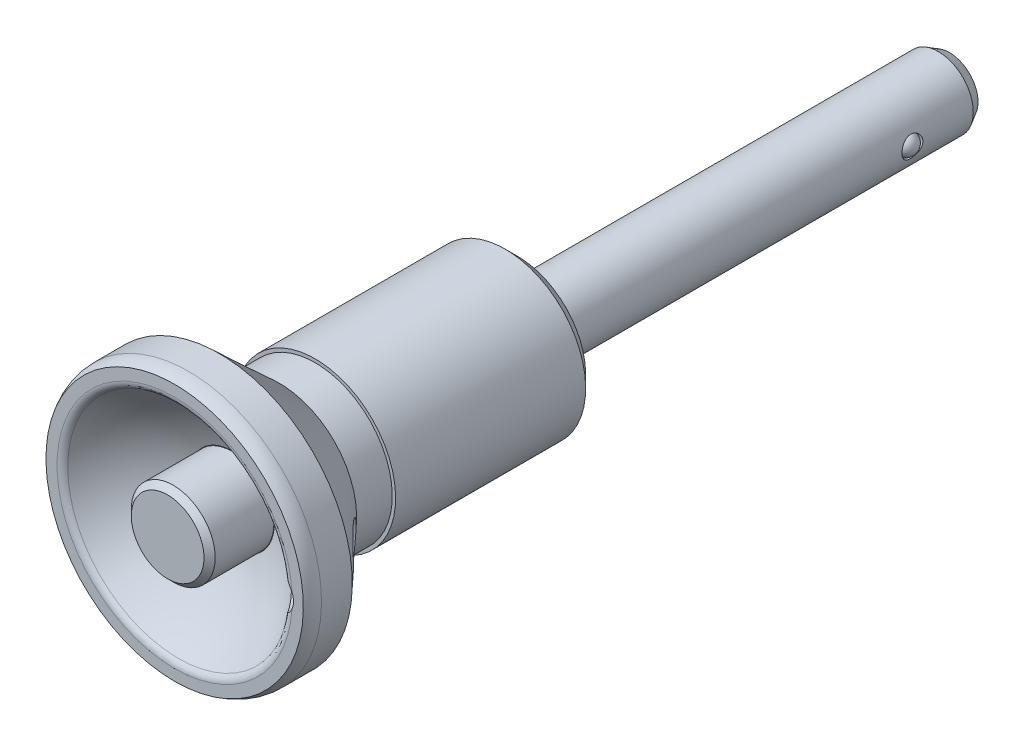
ISO-10303-21;
HEADER;
FILE_DESCRIPTION(('STEP AP214'),'2;1');
FILE_NAME('part.step','',(''),(''),'','','');
FILE_SCHEMA(('AUTOMOTIVE_DESIGN { 1 0 10303 214 1 1 1 1 }'));
ENDSEC;
DATA;
#1=APPLICATION_CONTEXT('core data for automotive mechanical design processes');
#2=APPLICATION_PROTOCOL_DEFINITION('international standard','automotive_design',2000,#1);
#3=PRODUCT_CONTEXT('',#1,'mechanical');
#4=PRODUCT('Part','Part','',(#3));
#5=PRODUCT_RELATED_PRODUCT_CATEGORY('part','',(#4));
#6=PRODUCT_DEFINITION_FORMATION('','',#4);
#7=PRODUCT_DEFINITION_CONTEXT('part definition',#1,'design');
#8=PRODUCT_DEFINITION('design','',#6,#7);
#9=PRODUCT_DEFINITION_SHAPE('','',#8);
#10=(LENGTH_UNIT() NAMED_UNIT(*) SI_UNIT(.MILLI.,.METRE.));
#11=(NAMED_UNIT(*) PLANE_ANGLE_UNIT() SI_UNIT($,.RADIAN.));
#12=(NAMED_UNIT(*) SI_UNIT($,.STERADIAN.) SOLID_ANGLE_UNIT());
#13=UNCERTAINTY_MEASURE_WITH_UNIT(LENGTH_MEASURE(1.E-05),#10,'distance_accuracy_value','');
#14=(GEOMETRIC_REPRESENTATION_CONTEXT(3) GLOBAL_UNCERTAINTY_ASSIGNED_CONTEXT((#13)) GLOBAL_UNIT_ASSIGNED_CONTEXT((#10,
#11,#12)) REPRESENTATION_CONTEXT('',''));
#15=CARTESIAN_POINT('',(0.,0.,0.));
#16=DIRECTION('',(0.,0.,1.));
#17=DIRECTION('',(1.,0.,0.));
#18=AXIS2_PLACEMENT_3D('',#15,#16,#17);
#19=CARTESIAN_POINT('',(0.,0.,-30.9));
#20=DIRECTION('',(0.,0.,-1.));
#21=DIRECTION('',(0.,1.,0.));
#22=AXIS2_PLACEMENT_3D('',#19,#20,#21);
#23=CYLINDRICAL_SURFACE('',#22,1.25);
#24=CARTESIAN_POINT('',(0.,0.,-30.9));
#25=DIRECTION('',(0.,0.,-1.));
#26=DIRECTION('',(0.,1.,0.));
#27=AXIS2_PLACEMENT_3D('',#24,#25,#26);
#28=CIRCLE('',#27,1.25);
#29=CARTESIAN_POINT('',(0.,1.25,-30.9));
#30=VERTEX_POINT('',#29);
#31=EDGE_CURVE('E137',#30,#30,#28,.T.);
#32=ORIENTED_EDGE('',*,*,#31,.T.);
#33=EDGE_LOOP('',(#32));
#34=FACE_BOUND('',#33,.T.);
#35=CARTESIAN_POINT('',(0.,0.,-26.9));
#36=DIRECTION('',(0.,0.,1.));
#37=DIRECTION('',(0.,-1.,0.));
#38=AXIS2_PLACEMENT_3D('',#35,#36,#37);
#39=CIRCLE('',#38,1.25);
#40=CARTESIAN_POINT('',(0.,-1.25,-26.9));
#41=VERTEX_POINT('',#40);
#42=EDGE_CURVE('E73',#41,#41,#39,.T.);
#43=ORIENTED_EDGE('',*,*,#42,.T.);
#44=EDGE_LOOP('',(#43));
#45=FACE_BOUND('',#44,.T.);
#46=ADVANCED_FACE('F14',(#34,#45),#23,.F.);
#47=CARTESIAN_POINT('',(3.5,0.,-25.75));
#48=DIRECTION('',(1.,0.,0.));
#49=DIRECTION('',(0.,1.,0.));
#50=AXIS2_PLACEMENT_3D('',#47,#48,#49);
#51=CYLINDRICAL_SURFACE('',#50,0.75);
#52=CARTESIAN_POINT('',(2.38484800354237,0.75,-25.75));
#53=CARTESIAN_POINT('',(2.38484842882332,0.749999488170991,-25.7910972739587));
#54=CARTESIAN_POINT('',(2.38592195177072,0.746610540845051,-25.8321996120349));
#55=CARTESIAN_POINT('',(2.39008289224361,0.733179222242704,-25.9132026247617));
#56=CARTESIAN_POINT('',(2.39317098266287,0.72313462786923,-25.9531028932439));
#57=CARTESIAN_POINT('',(2.40098051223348,0.696763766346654,-26.0305173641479));
#58=CARTESIAN_POINT('',(2.40569923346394,0.680447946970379,-26.0680354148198));
#59=CARTESIAN_POINT('',(2.41623466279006,0.642032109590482,-26.1398109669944));
#60=CARTESIAN_POINT('',(2.42205153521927,0.619931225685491,-26.1740679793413));
#61=CARTESIAN_POINT('',(2.43433431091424,0.569823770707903,-26.2394331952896));
#62=CARTESIAN_POINT('',(2.44081404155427,0.541666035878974,-26.2704229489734));
#63=CARTESIAN_POINT('',(2.4535743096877,0.480568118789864,-26.327318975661));
#64=CARTESIAN_POINT('',(2.45985482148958,0.447627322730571,-26.3532245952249));
#65=CARTESIAN_POINT('',(2.47166607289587,0.377055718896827,-26.3997313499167));
#66=CARTESIAN_POINT('',(2.47717862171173,0.339342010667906,-26.4202117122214));
#67=CARTESIAN_POINT('',(2.48667217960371,0.260812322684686,-26.4544936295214));
#68=CARTESIAN_POINT('',(2.49065351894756,0.219997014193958,-26.4682966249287));
#69=CARTESIAN_POINT('',(2.49653823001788,0.137661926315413,-26.4884400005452));
#70=CARTESIAN_POINT('',(2.49849778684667,0.0961956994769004,-26.4949825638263));
#71=CARTESIAN_POINT('',(2.50031600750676,0.0127109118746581,-26.5010586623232));
#72=CARTESIAN_POINT('',(2.5001751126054,-0.0293075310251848,-26.500593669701));
#73=CARTESIAN_POINT('',(2.49784801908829,-0.11128557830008,-26.4928035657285));
#74=CARTESIAN_POINT('',(2.49572710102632,-0.151268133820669,-26.4856974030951));
#75=CARTESIAN_POINT('',(2.48975761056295,-0.229444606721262,-26.4651843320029));
#76=CARTESIAN_POINT('',(2.48590892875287,-0.267638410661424,-26.4517770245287));
#77=CARTESIAN_POINT('',(2.47682610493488,-0.341673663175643,-26.4188939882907));
#78=CARTESIAN_POINT('',(2.47157634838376,-0.377482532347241,-26.3993493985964));
#79=CARTESIAN_POINT('',(2.46024820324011,-0.445382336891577,-26.3548010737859));
#80=CARTESIAN_POINT('',(2.45416961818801,-0.477472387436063,-26.3297960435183));
#81=CARTESIAN_POINT('',(2.44155775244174,-0.5383302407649,-26.2739011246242));
#82=CARTESIAN_POINT('',(2.43501597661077,-0.566922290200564,-26.2428215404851));
#83=CARTESIAN_POINT('',(2.42241989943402,-0.618538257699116,-26.176244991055));
#84=CARTESIAN_POINT('',(2.41636564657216,-0.641561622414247,-26.1407475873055));
#85=CARTESIAN_POINT('',(2.40538951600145,-0.681569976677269,-26.0658802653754));
#86=CARTESIAN_POINT('',(2.40047905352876,-0.698494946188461,-26.0264764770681));
#87=CARTESIAN_POINT('',(2.39248196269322,-0.725416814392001,-25.9451963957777));
#88=CARTESIAN_POINT('',(2.38939473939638,-0.735415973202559,-25.9033209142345));
#89=CARTESIAN_POINT('',(2.38552424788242,-0.747873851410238,-25.8199588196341));
#90=CARTESIAN_POINT('',(2.38465939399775,-0.75059973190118,-25.7785158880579));
#91=CARTESIAN_POINT('',(2.38510596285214,-0.749179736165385,-25.6957635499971));
#92=CARTESIAN_POINT('',(2.38641708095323,-0.745034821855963,-25.6544541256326));
#93=CARTESIAN_POINT('',(2.390987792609,-0.730228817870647,-25.5742558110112));
#94=CARTESIAN_POINT('',(2.39419588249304,-0.719739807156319,-25.5353319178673));
#95=CARTESIAN_POINT('',(2.40214570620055,-0.692742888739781,-25.4597991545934));
#96=CARTESIAN_POINT('',(2.40688767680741,-0.67623405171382,-25.42319064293));
#97=CARTESIAN_POINT('',(2.41752917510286,-0.637159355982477,-25.3522412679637));
#98=CARTESIAN_POINT('',(2.42345635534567,-0.614442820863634,-25.317987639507));
#99=CARTESIAN_POINT('',(2.43574102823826,-0.563776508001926,-25.2536809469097));
#100=CARTESIAN_POINT('',(2.44209862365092,-0.535825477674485,-25.2236288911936));
#101=CARTESIAN_POINT('',(2.45481816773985,-0.474227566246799,-25.1674097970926));
#102=CARTESIAN_POINT('',(2.46117122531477,-0.440405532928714,-25.1414321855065));
#103=CARTESIAN_POINT('',(2.4729242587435,-0.36873089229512,-25.0955166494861));
#104=CARTESIAN_POINT('',(2.47832428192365,-0.330878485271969,-25.0755784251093));
#105=CARTESIAN_POINT('',(2.48752985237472,-0.25246775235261,-25.0424999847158));
#106=CARTESIAN_POINT('',(2.49134726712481,-0.21193231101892,-25.0293089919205));
#107=CARTESIAN_POINT('',(2.49700989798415,-0.129084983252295,-25.0099695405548));
#108=CARTESIAN_POINT('',(2.4988556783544,-0.0867736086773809,-25.0038190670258));
#109=CARTESIAN_POINT('',(2.50033272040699,-0.00332607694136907,-24.9988884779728));
#110=CARTESIAN_POINT('',(2.50004652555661,0.0377925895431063,-24.9998336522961));
#111=CARTESIAN_POINT('',(2.49748632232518,0.119259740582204,-25.0084108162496));
#112=CARTESIAN_POINT('',(2.49521242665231,0.159608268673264,-25.0160424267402));
#113=CARTESIAN_POINT('',(2.48895584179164,0.23796790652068,-25.0376058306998));
#114=CARTESIAN_POINT('',(2.48499176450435,0.2759994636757,-25.0514690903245));
#115=CARTESIAN_POINT('',(2.47576471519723,0.34921661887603,-25.0850409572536));
#116=CARTESIAN_POINT('',(2.47050152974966,0.38440174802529,-25.1047505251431));
#117=CARTESIAN_POINT('',(2.45901982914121,0.45215094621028,-25.150186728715));
#118=CARTESIAN_POINT('',(2.45277613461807,0.484595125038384,-25.1760857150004));
#119=CARTESIAN_POINT('',(2.44011768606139,0.54476878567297,-25.2328551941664));
#120=CARTESIAN_POINT('',(2.43370288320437,0.57249690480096,-25.2637271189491));
#121=CARTESIAN_POINT('',(2.42120340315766,0.623281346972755,-25.3306703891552));
#122=CARTESIAN_POINT('',(2.41513426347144,0.646173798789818,-25.3668692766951));
#123=CARTESIAN_POINT('',(2.40426273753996,0.685521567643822,-25.4427775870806));
#124=CARTESIAN_POINT('',(2.3994597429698,0.70197997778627,-25.4824853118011));
#125=CARTESIAN_POINT('',(2.39213908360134,0.726509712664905,-25.5598702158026));
#126=CARTESIAN_POINT('',(2.38943077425,0.735294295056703,-25.5973043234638));
#127=CARTESIAN_POINT('',(2.38578521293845,0.747039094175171,-25.6731576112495));
#128=CARTESIAN_POINT('',(2.38484760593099,0.750000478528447,-25.7115765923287));
#129=CARTESIAN_POINT('',(2.38484800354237,0.75,-25.75));
#130=B_SPLINE_CURVE_WITH_KNOTS('',3,(#52,#53,#54,#55,#56,#57,#58,#59,#60,#61,#62,#63,#64,#65,
#66,#67,#68,#69,#70,#71,#72,#73,#74,#75,#76,#77,#78,#79,#80,#81,#82,#83,#84,#85,#86,#87,#88,#89,
#90,#91,#92,#93,#94,#95,#96,#97,#98,#99,#100,#101,#102,#103,#104,#105,#106,#107,#108,#109,#110,
#111,#112,#113,#114,#115,#116,#117,#118,#119,#120,#121,#122,#123,#124,#125,#126,#127,#128,#129),
.UNSPECIFIED.,.T.,.F.,(4,2,2,2,2,2,2,2,2,2,2,2,2,2,2,2,2,2,2,2,2,2,2,2,2,2,2,2,2,2,2,2,2,2,2,2,
2,2,4),(0.,0.123150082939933,0.246341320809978,0.369328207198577,0.492333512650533,
0.618865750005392,0.745414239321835,0.874579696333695,1.00371727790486,1.12916070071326,
1.25457777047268,1.37600062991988,1.49743117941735,1.62027604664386,1.74315008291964,
1.87076073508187,1.99838406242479,2.12723119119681,2.25603625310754,2.38004040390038,
2.50402719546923,2.62479297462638,2.74557740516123,2.86960365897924,2.99365962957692,
3.12239753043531,3.2511290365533,3.37887695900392,3.50658831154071,3.6293815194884,
3.75216776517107,3.87363548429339,3.99512317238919,4.12049813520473,4.24590926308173,
4.37505819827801,4.50414496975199,4.61930576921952,4.73444347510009),.UNSPECIFIED.);
#131=CARTESIAN_POINT('',(2.38484800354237,0.75,-25.75));
#132=VERTEX_POINT('',#131);
#133=EDGE_CURVE('E472',#132,#132,#130,.T.);
#134=ORIENTED_EDGE('',*,*,#133,.F.);
#135=EDGE_LOOP('',(#134));
#136=FACE_BOUND('',#135,.T.);
#137=CARTESIAN_POINT('',(2.12206555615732,0.,-26.5));
#138=CARTESIAN_POINT('',(2.122065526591,0.0420016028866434,-26.4999980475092));
#139=CARTESIAN_POINT('',(2.1217765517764,0.0840371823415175,-26.4964593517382));
#140=CARTESIAN_POINT('',(2.12061587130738,0.166953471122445,-26.4823928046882));
#141=CARTESIAN_POINT('',(2.11974338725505,0.207832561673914,-26.4718556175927));
#142=CARTESIAN_POINT('',(2.11740251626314,0.28721580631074,-26.444098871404));
#143=CARTESIAN_POINT('',(2.11593446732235,0.325721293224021,-26.4268831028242));
#144=CARTESIAN_POINT('',(2.11237724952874,0.399276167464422,-26.3862728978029));
#145=CARTESIAN_POINT('',(2.11028825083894,0.434326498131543,-26.3628801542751));
#146=CARTESIAN_POINT('',(2.10543833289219,0.500027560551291,-26.3105688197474));
#147=CARTESIAN_POINT('',(2.10267678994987,0.530674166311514,-26.2816451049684));
#148=CARTESIAN_POINT('',(2.09639815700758,0.586669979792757,-26.219125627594));
#149=CARTESIAN_POINT('',(2.092881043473,0.612019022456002,-26.1855297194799));
#150=CARTESIAN_POINT('',(2.08489768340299,0.656755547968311,-26.1146022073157));
#151=CARTESIAN_POINT('',(2.08042974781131,0.67613226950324,-26.0772640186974));
#152=CARTESIAN_POINT('',(2.07020296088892,0.708344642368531,-25.999991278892));
#153=CARTESIAN_POINT('',(2.0644438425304,0.721178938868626,-25.9600561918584));
#154=CARTESIAN_POINT('',(2.05389778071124,0.735194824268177,-25.8996910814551));
#155=CARTESIAN_POINT('',(2.05010571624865,0.738983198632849,-25.8796691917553));
#156=CARTESIAN_POINT('',(2.04141297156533,0.74488576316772,-25.8397229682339));
#157=CARTESIAN_POINT('',(2.03651754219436,0.747007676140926,-25.8197986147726));
#158=CARTESIAN_POINT('',(2.02684555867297,0.748972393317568,-25.790414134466));
#159=CARTESIAN_POINT('',(2.02323558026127,0.749424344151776,-25.7807072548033));
#160=CARTESIAN_POINT('',(2.01701848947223,0.749752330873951,-25.7694169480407));
#161=CARTESIAN_POINT('',(2.0156749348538,0.749806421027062,-25.767179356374));
#162=CARTESIAN_POINT('',(2.01268052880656,0.749891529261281,-25.7629215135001));
#163=CARTESIAN_POINT('',(2.01103259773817,0.749922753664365,-25.7608994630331));
#164=CARTESIAN_POINT('',(2.0084776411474,0.74995123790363,-25.758574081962));
#165=CARTESIAN_POINT('',(2.00780452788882,0.74995728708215,-25.7580205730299));
#166=CARTESIAN_POINT('',(2.00638639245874,0.749967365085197,-25.7570139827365));
#167=CARTESIAN_POINT('',(2.00564151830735,0.749971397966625,-25.7565607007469));
#168=CARTESIAN_POINT('',(2.00429958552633,0.74997677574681,-25.7559086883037));
#169=CARTESIAN_POINT('',(2.00372014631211,0.749978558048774,-25.7556742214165));
#170=CARTESIAN_POINT('',(2.00253072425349,0.74998127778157,-25.7553026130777));
#171=CARTESIAN_POINT('',(2.00192078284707,0.749982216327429,-25.755165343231));
#172=CARTESIAN_POINT('',(2.00068118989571,0.749983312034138,-25.7550039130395));
#173=CARTESIAN_POINT('',(2.0000514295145,0.749983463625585,-25.754980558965));
#174=CARTESIAN_POINT('',(1.99879872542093,0.749982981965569,-25.7550524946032));
#175=CARTESIAN_POINT('',(1.99817578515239,0.749982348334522,-25.7551478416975));
#176=CARTESIAN_POINT('',(1.99687877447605,0.74998011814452,-25.7554634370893));
#177=CARTESIAN_POINT('',(1.99620827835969,0.749978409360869,-25.7556980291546));
#178=CARTESIAN_POINT('',(1.99491412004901,0.749973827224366,-25.7562722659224));
#179=CARTESIAN_POINT('',(1.99429055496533,0.749970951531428,-25.756612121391));
#180=CARTESIAN_POINT('',(1.99269674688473,0.749961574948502,-25.757617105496));
#181=CARTESIAN_POINT('',(1.99176918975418,0.749953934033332,-25.7583489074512));
#182=CARTESIAN_POINT('',(1.99002713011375,0.749934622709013,-25.759935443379));
#183=CARTESIAN_POINT('',(1.98921298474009,0.74992293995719,-25.7607905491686));
#184=CARTESIAN_POINT('',(1.9861138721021,0.749867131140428,-25.7643633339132));
#185=CARTESIAN_POINT('',(1.98416699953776,0.749805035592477,-25.767365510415));
#186=CARTESIAN_POINT('',(1.98064972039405,0.749635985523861,-25.7735811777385));
#187=CARTESIAN_POINT('',(1.97908220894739,0.749528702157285,-25.776796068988));
#188=CARTESIAN_POINT('',(1.97118573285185,0.748823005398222,-25.7943323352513));
#189=CARTESIAN_POINT('',(1.96669087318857,0.747791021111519,-25.8094291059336));
#190=CARTESIAN_POINT('',(1.9587074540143,0.744776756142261,-25.8397066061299));
#191=CARTESIAN_POINT('',(1.95522081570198,0.742792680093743,-25.8548874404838));
#192=CARTESIAN_POINT('',(1.94374396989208,0.733930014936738,-25.9094467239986));
#193=CARTESIAN_POINT('',(1.93743955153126,0.724291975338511,-25.9488040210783));
#194=CARTESIAN_POINT('',(1.92627183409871,0.698725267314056,-26.0255607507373));
#195=CARTESIAN_POINT('',(1.92140902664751,0.682794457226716,-26.0629595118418));
#196=CARTESIAN_POINT('',(1.91269378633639,0.644884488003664,-26.1350867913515));
#197=CARTESIAN_POINT('',(1.90884957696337,0.622858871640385,-26.169792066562));
#198=CARTESIAN_POINT('',(1.90194437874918,0.573395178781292,-26.2351809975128));
#199=CARTESIAN_POINT('',(1.89888335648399,0.545957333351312,-26.2658648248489));
#200=CARTESIAN_POINT('',(1.89337289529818,0.485652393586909,-26.3230715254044));
#201=CARTESIAN_POINT('',(1.89094062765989,0.452666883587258,-26.3494714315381));
#202=CARTESIAN_POINT('',(1.88672141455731,0.382705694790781,-26.3963827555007));
#203=CARTESIAN_POINT('',(1.88493451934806,0.345729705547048,-26.4168937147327));
#204=CARTESIAN_POINT('',(1.88197364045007,0.268898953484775,-26.4514014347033));
#205=CARTESIAN_POINT('',(1.88079872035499,0.229048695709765,-26.4654081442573));
#206=CARTESIAN_POINT('',(1.87903847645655,0.147552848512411,-26.4865461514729));
#207=CARTESIAN_POINT('',(1.87845313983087,0.105907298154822,-26.4936775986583));
#208=CARTESIAN_POINT('',(1.87786418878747,0.0220644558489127,-26.5008535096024));
#209=CARTESIAN_POINT('',(1.8778597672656,-0.0201319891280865,-26.5009078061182));
#210=CARTESIAN_POINT('',(1.87843054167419,-0.103934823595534,-26.4939525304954));
#211=CARTESIAN_POINT('',(1.87900573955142,-0.145541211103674,-26.4869429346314));
#212=CARTESIAN_POINT('',(1.88074362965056,-0.226969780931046,-26.4660662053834));
#213=CARTESIAN_POINT('',(1.88190614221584,-0.266792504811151,-26.4522011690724));
#214=CARTESIAN_POINT('',(1.88483707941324,-0.343537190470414,-26.4180169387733));
#215=CARTESIAN_POINT('',(1.88660547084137,-0.38045931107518,-26.3976980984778));
#216=CARTESIAN_POINT('',(1.89078474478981,-0.450386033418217,-26.3511798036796));
#217=CARTESIAN_POINT('',(1.89319605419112,-0.483388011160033,-26.3249764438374));
#218=CARTESIAN_POINT('',(1.89872480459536,-0.544528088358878,-26.2674467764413));
#219=CARTESIAN_POINT('',(1.90184247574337,-0.572664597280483,-26.2361188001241));
#220=CARTESIAN_POINT('',(1.90891559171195,-0.623332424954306,-26.1691939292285));
#221=CARTESIAN_POINT('',(1.91287294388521,-0.645850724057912,-26.1335873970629));
#222=CARTESIAN_POINT('',(1.92185974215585,-0.684556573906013,-26.059244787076));
#223=CARTESIAN_POINT('',(1.92688769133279,-0.700752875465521,-26.0205131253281));
#224=CARTESIAN_POINT('',(1.93569998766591,-0.71991205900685,-25.9613088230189));
#225=CARTESIAN_POINT('',(1.93882374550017,-0.725422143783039,-25.9415275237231));
#226=CARTESIAN_POINT('',(1.94572571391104,-0.734783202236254,-25.9016930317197));
#227=CARTESIAN_POINT('',(1.94950340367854,-0.738635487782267,-25.8816400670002));
#228=CARTESIAN_POINT('',(1.9581456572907,-0.744662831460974,-25.8415775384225));
#229=CARTESIAN_POINT('',(1.96300736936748,-0.746842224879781,-25.8215679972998));
#230=CARTESIAN_POINT('',(1.97256849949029,-0.748884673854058,-25.7920280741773));
#231=CARTESIAN_POINT('',(1.97613548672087,-0.749360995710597,-25.7822567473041));
#232=CARTESIAN_POINT('',(1.98218536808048,-0.749715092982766,-25.7708069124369));
#233=CARTESIAN_POINT('',(1.98348487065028,-0.749774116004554,-25.7685398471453));
#234=CARTESIAN_POINT('',(1.98636386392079,-0.74986881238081,-25.7641876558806));
#235=CARTESIAN_POINT('',(1.98794184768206,-0.749904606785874,-25.7621016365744));
#236=CARTESIAN_POINT('',(1.99047765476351,-0.749940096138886,-25.759509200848));
#237=CARTESIAN_POINT('',(1.99123387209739,-0.749948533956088,-25.7588100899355));
#238=CARTESIAN_POINT('',(1.99284087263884,-0.749962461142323,-25.7575302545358));
#239=CARTESIAN_POINT('',(1.99369132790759,-0.74996796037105,-25.7569491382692));
#240=CARTESIAN_POINT('',(1.99514970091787,-0.749974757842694,-25.7561608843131));
#241=CARTESIAN_POINT('',(1.99572587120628,-0.749976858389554,-25.7558957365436));
#242=CARTESIAN_POINT('',(1.99691288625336,-0.749980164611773,-25.7554589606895));
#243=CARTESIAN_POINT('',(1.99752368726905,-0.74998137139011,-25.7552872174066));
#244=CARTESIAN_POINT('',(1.99877257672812,-0.749982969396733,-25.755055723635));
#245=CARTESIAN_POINT('',(1.99941086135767,-0.749983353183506,-25.7549969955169));
#246=CARTESIAN_POINT('',(2.00068685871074,-0.749983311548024,-25.7550032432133));
#247=CARTESIAN_POINT('',(2.0013245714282,-0.749982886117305,-25.7550682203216));
#248=CARTESIAN_POINT('',(2.00250998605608,-0.749981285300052,-25.7552992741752));
#249=CARTESIAN_POINT('',(2.00306003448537,-0.749980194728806,-25.7554538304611));
#250=CARTESIAN_POINT('',(2.00413225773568,-0.749977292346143,-25.7558393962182));
#251=CARTESIAN_POINT('',(2.00465441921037,-0.749975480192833,-25.7560704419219));
#252=CARTESIAN_POINT('',(2.00604384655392,-0.749969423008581,-25.7567872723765));
#253=CARTESIAN_POINT('',(2.00687904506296,-0.749964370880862,-25.7573347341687));
#254=CARTESIAN_POINT('',(2.00845949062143,-0.749951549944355,-25.7585470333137));
#255=CARTESIAN_POINT('',(2.00920439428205,-0.749943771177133,-25.7592122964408));
#256=CARTESIAN_POINT('',(2.01179340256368,-0.749909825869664,-25.7617738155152));
#257=CARTESIAN_POINT('',(2.01341810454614,-0.749874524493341,-25.7638864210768));
#258=CARTESIAN_POINT('',(2.01637599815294,-0.749779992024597,-25.7683057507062));
#259=CARTESIAN_POINT('',(2.01770709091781,-0.749720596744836,-25.7706137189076));
#260=CARTESIAN_POINT('',(2.02386184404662,-0.749364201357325,-25.782208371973));
#261=CARTESIAN_POINT('',(2.02747600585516,-0.748881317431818,-25.7921055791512));
#262=CARTESIAN_POINT('',(2.03390293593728,-0.747496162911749,-25.8120791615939));
#263=CARTESIAN_POINT('',(2.03671325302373,-0.746592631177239,-25.8221559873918));
#264=CARTESIAN_POINT('',(2.04854756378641,-0.741498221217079,-25.8682211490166));
#265=CARTESIAN_POINT('',(2.05509857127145,-0.734806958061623,-25.9046218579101));
#266=CARTESIAN_POINT('',(2.06668346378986,-0.716059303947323,-25.9761498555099));
#267=CARTESIAN_POINT('',(2.07171700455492,-0.704001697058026,-26.0112768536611));
#268=CARTESIAN_POINT('',(2.08068762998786,-0.674801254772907,-26.0794028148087));
#269=CARTESIAN_POINT('',(2.08462795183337,-0.65767375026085,-26.1124078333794));
#270=CARTESIAN_POINT('',(2.09177764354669,-0.618687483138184,-26.1755655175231));
#271=CARTESIAN_POINT('',(2.09498703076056,-0.596828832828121,-26.2057182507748));
#272=CARTESIAN_POINT('',(2.10116735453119,-0.545719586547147,-26.2661901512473));
#273=CARTESIAN_POINT('',(2.10405302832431,-0.515877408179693,-26.2960211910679));
#274=CARTESIAN_POINT('',(2.10914374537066,-0.451566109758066,-26.3503003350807));
#275=CARTESIAN_POINT('',(2.11134835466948,-0.417094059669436,-26.3747450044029));
#276=CARTESIAN_POINT('',(2.11512569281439,-0.344521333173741,-26.4175173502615));
#277=CARTESIAN_POINT('',(2.11669850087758,-0.306421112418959,-26.4358457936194));
#278=CARTESIAN_POINT('',(2.11924053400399,-0.227705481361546,-26.4658349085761));
#279=CARTESIAN_POINT('',(2.12021060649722,-0.187093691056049,-26.477504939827));
#280=CARTESIAN_POINT('',(2.12128084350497,-0.121823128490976,-26.4904453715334));
#281=CARTESIAN_POINT('',(2.12157516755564,-0.0976020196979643,-26.494024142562));
#282=CARTESIAN_POINT('',(2.1219675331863,-0.0489244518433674,-26.4988020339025));
#283=CARTESIAN_POINT('',(2.12206557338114,-0.0244679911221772,-26.5000011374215));
#284=CARTESIAN_POINT('',(2.12206555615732,0.,-26.5));
#285=B_SPLINE_CURVE_WITH_KNOTS('',3,(#137,#138,#139,#140,#141,#142,#143,#144,#145,#146,#147,
#148,#149,#150,#151,#152,#153,#154,#155,#156,#157,#158,#159,#160,#161,#162,#163,#164,#165,#166,
#167,#168,#169,#170,#171,#172,#173,#174,#175,#176,#177,#178,#179,#180,#181,#182,#183,#184,#185,
#186,#187,#188,#189,#190,#191,#192,#193,#194,#195,#196,#197,#198,#199,#200,#201,#202,#203,#204,
#205,#206,#207,#208,#209,#210,#211,#212,#213,#214,#215,#216,#217,#218,#219,#220,#221,#222,#223,
#224,#225,#226,#227,#228,#229,#230,#231,#232,#233,#234,#235,#236,#237,#238,#239,#240,#241,#242,
#243,#244,#245,#246,#247,#248,#249,#250,#251,#252,#253,#254,#255,#256,#257,#258,#259,#260,#261,
#262,#263,#264,#265,#266,#267,#268,#269,#270,#271,#272,#273,#274,#275,#276,#277,#278,#279,#280,
#281,#282,#283,#284),.UNSPECIFIED.,.T.,.F.,(4,2,2,2,2,2,2,2,2,2,2,2,2,2,2,2,2,2,2,2,2,2,2,2,2,2,
2,2,2,2,2,2,2,2,2,2,2,2,2,2,2,2,2,2,2,2,2,2,2,2,2,2,2,2,2,2,2,2,2,2,2,2,2,2,2,2,2,2,2,2,2,2,2,
4),(0.,0.125915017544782,0.251998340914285,0.37801020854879,0.503987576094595,0.630082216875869,
0.75618078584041,0.882505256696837,1.00885587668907,1.07095509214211,1.13276479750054,
1.16364176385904,1.17146560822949,1.17921795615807,1.18182645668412,1.18442968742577,
1.18629815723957,1.18816415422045,1.19004333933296,1.19192343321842,1.19404265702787,
1.19616615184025,1.19969056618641,1.20322583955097,1.21387723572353,1.22460752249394,
1.27164281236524,1.31876714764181,1.44104687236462,1.56336824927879,1.68664899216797,
1.80992447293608,1.93627677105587,2.06263890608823,2.18880711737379,2.31497258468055,
2.44096276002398,2.5669533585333,2.69290544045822,2.81885062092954,2.94487963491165,
3.07094977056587,3.19730940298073,3.32349350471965,3.3857459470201,3.44794903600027,
3.50999037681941,3.54103548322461,3.54886944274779,3.55666224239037,3.55974510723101,
3.5628175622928,3.56471411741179,3.56660832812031,3.56851959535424,3.57043088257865,
3.57213834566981,3.57384661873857,3.57682501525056,3.5798144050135,3.58774744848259,
3.59573548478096,3.62715703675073,3.65867340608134,3.77072612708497,3.88280425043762,
3.9945468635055,4.10628682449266,4.23255563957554,4.35890474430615,4.48523800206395,
4.61139323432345,4.68474438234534,4.7580960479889),.UNSPECIFIED.);
#286=CARTESIAN_POINT('',(1.98517452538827,-0.749829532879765,-25.7659897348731));
#287=VERTEX_POINT('',#286);
#288=CARTESIAN_POINT('',(1.98517452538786,0.749829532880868,-25.7659897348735));
#289=VERTEX_POINT('',#288);
#290=EDGE_CURVE('E32',#287,#289,#285,.T.);
#291=ORIENTED_EDGE('',*,*,#290,.F.);
#292=CARTESIAN_POINT('',(1.98511012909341,0.75,-25.75));
#293=CARTESIAN_POINT('',(1.98510947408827,0.750000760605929,-25.7906891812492));
#294=CARTESIAN_POINT('',(1.98637478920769,0.746677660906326,-25.8313730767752));
#295=CARTESIAN_POINT('',(1.99126881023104,0.733525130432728,-25.9115254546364));
#296=CARTESIAN_POINT('',(1.99489767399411,0.723695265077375,-25.9509938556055));
#297=CARTESIAN_POINT('',(2.00405749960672,0.697925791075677,-26.027538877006));
#298=CARTESIAN_POINT('',(2.00958434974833,0.681999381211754,-26.0646204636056));
#299=CARTESIAN_POINT('',(2.02191113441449,0.644534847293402,-26.1355987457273));
#300=CARTESIAN_POINT('',(2.02871140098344,0.622995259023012,-26.1694946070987));
#301=CARTESIAN_POINT('',(2.04315464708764,0.573899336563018,-26.2346325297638));
#302=CARTESIAN_POINT('',(2.05082046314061,0.546136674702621,-26.2657140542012));
#303=CARTESIAN_POINT('',(2.06593925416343,0.485821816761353,-26.3228913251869));
#304=CARTESIAN_POINT('',(2.07339218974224,0.45326874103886,-26.3489861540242));
#305=CARTESIAN_POINT('',(2.08751316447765,0.383102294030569,-26.396198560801));
#306=CARTESIAN_POINT('',(2.09415125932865,0.345367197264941,-26.4171449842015));
#307=CARTESIAN_POINT('',(2.10562302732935,0.266633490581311,-26.4523276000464));
#308=CARTESIAN_POINT('',(2.11045725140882,0.225635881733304,-26.4665658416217));
#309=CARTESIAN_POINT('',(2.11761468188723,0.143226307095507,-26.4873748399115));
#310=CARTESIAN_POINT('',(2.12002790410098,0.101891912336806,-26.4942212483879));
#311=CARTESIAN_POINT('',(2.12239260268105,0.0185951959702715,-26.5009318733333));
#312=CARTESIAN_POINT('',(2.12234479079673,-0.0233669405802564,-26.5007981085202));
#313=CARTESIAN_POINT('',(2.1198520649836,-0.104765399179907,-26.4937203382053));
#314=CARTESIAN_POINT('',(2.11751277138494,-0.144231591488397,-26.4870763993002));
#315=CARTESIAN_POINT('',(2.11083531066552,-0.221447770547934,-26.4676670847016));
#316=CARTESIAN_POINT('',(2.10649700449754,-0.259197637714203,-26.4549012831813));
#317=CARTESIAN_POINT('',(2.09618170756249,-0.332529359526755,-26.4234526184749));
#318=CARTESIAN_POINT('',(2.09018277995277,-0.368073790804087,-26.4046899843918));
#319=CARTESIAN_POINT('',(2.07716261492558,-0.435593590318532,-26.3618481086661));
#320=CARTESIAN_POINT('',(2.07014107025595,-0.467567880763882,-26.3377672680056));
#321=CARTESIAN_POINT('',(2.05537310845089,-0.528817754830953,-26.2834909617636));
#322=CARTESIAN_POINT('',(2.04760798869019,-0.557863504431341,-26.2530408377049));
#323=CARTESIAN_POINT('',(2.03253136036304,-0.610516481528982,-26.187644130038));
#324=CARTESIAN_POINT('',(2.02521994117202,-0.634122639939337,-26.1526966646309));
#325=CARTESIAN_POINT('',(2.01176867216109,-0.675599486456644,-26.0784862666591));
#326=CARTESIAN_POINT('',(2.00565194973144,-0.693360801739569,-26.039157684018));
#327=CARTESIAN_POINT('',(1.99554932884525,-0.721926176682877,-25.9577958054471));
#328=CARTESIAN_POINT('',(1.99156240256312,-0.732733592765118,-25.9157638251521));
#329=CARTESIAN_POINT('',(1.98640793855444,-0.746590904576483,-25.8324370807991));
#330=CARTESIAN_POINT('',(1.98510948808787,-0.750001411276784,-25.7912104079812));
#331=CARTESIAN_POINT('',(1.98511077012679,-0.749998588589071,-25.7087622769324));
#332=CARTESIAN_POINT('',(1.98640995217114,-0.746586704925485,-25.6675408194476));
#333=CARTESIAN_POINT('',(1.99132841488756,-0.73336148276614,-25.5880087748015));
#334=CARTESIAN_POINT('',(1.99485212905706,-0.723811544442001,-25.5496478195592));
#335=CARTESIAN_POINT('',(2.00371360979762,-0.698904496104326,-25.4750848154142));
#336=CARTESIAN_POINT('',(2.00905172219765,-0.683546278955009,-25.4388831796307));
#337=CARTESIAN_POINT('',(2.02116838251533,-0.646857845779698,-25.3682772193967));
#338=CARTESIAN_POINT('',(2.02799034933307,-0.625339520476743,-25.3339783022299));
#339=CARTESIAN_POINT('',(2.0422272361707,-0.577148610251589,-25.2693487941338));
#340=CARTESIAN_POINT('',(2.049642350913,-0.550474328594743,-25.2390195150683));
#341=CARTESIAN_POINT('',(2.06472450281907,-0.490984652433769,-25.1814583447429));
#342=CARTESIAN_POINT('',(2.07238288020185,-0.457911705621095,-25.1544895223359));
#343=CARTESIAN_POINT('',(2.08669071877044,-0.3875205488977,-25.1064607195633));
#344=CARTESIAN_POINT('',(2.09334020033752,-0.350202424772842,-25.085400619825));
#345=CARTESIAN_POINT('',(2.10486052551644,-0.272501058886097,-25.04996007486));
#346=CARTESIAN_POINT('',(2.10974080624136,-0.232135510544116,-25.0355440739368));
#347=CARTESIAN_POINT('',(2.11721112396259,-0.149343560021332,-25.0137754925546));
#348=CARTESIAN_POINT('',(2.11980210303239,-0.106918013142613,-25.0064200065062));
#349=CARTESIAN_POINT('',(2.1223221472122,-0.0236025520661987,-24.9992676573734));
#350=CARTESIAN_POINT('',(2.12238350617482,0.0172514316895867,-24.9990951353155));
#351=CARTESIAN_POINT('',(2.12017213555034,0.0983795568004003,-25.0053683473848));
#352=CARTESIAN_POINT('',(2.11789963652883,0.138653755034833,-25.0118134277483));
#353=CARTESIAN_POINT('',(2.11133034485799,0.216681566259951,-25.0308817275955));
#354=CARTESIAN_POINT('',(2.10707427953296,0.25446919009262,-25.0433808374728));
#355=CARTESIAN_POINT('',(2.09697770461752,0.327420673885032,-25.0740837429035));
#356=CARTESIAN_POINT('',(2.09113689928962,0.36258404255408,-25.0922886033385));
#357=CARTESIAN_POINT('',(2.07817677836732,0.430810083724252,-25.1347117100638));
#358=CARTESIAN_POINT('',(2.07101599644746,0.463734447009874,-25.1591395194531));
#359=CARTESIAN_POINT('',(2.05630552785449,0.52513659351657,-25.2129712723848));
#360=CARTESIAN_POINT('',(2.04875571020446,0.553612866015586,-25.2423768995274));
#361=CARTESIAN_POINT('',(2.03370376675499,0.606635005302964,-25.3069242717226));
#362=CARTESIAN_POINT('',(2.02621942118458,0.630943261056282,-25.3422660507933));
#363=CARTESIAN_POINT('',(2.01255226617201,0.673269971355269,-25.4167698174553));
#364=CARTESIAN_POINT('',(2.00636932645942,0.691289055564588,-25.4559314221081));
#365=CARTESIAN_POINT('',(1.996117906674,0.720357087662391,-25.5368652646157));
#366=CARTESIAN_POINT('',(1.9920414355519,0.731432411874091,-25.5786269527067));
#367=CARTESIAN_POINT('',(1.98653852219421,0.746251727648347,-25.6635948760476));
#368=CARTESIAN_POINT('',(1.98511082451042,0.749999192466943,-25.706800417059));
#369=CARTESIAN_POINT('',(1.98511012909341,0.75,-25.75));
#370=B_SPLINE_CURVE_WITH_KNOTS('',3,(#292,#293,#294,#295,#296,#297,#298,#299,#300,#301,#302,
#303,#304,#305,#306,#307,#308,#309,#310,#311,#312,#313,#314,#315,#316,#317,#318,#319,#320,#321,
#322,#323,#324,#325,#326,#327,#328,#329,#330,#331,#332,#333,#334,#335,#336,#337,#338,#339,#340,
#341,#342,#343,#344,#345,#346,#347,#348,#349,#350,#351,#352,#353,#354,#355,#356,#357,#358,#359,
#360,#361,#362,#363,#364,#365,#366,#367,#368,#369),.UNSPECIFIED.,.T.,.F.,(4,2,2,2,2,2,2,2,2,2,2,
2,2,2,2,2,2,2,2,2,2,2,2,2,2,2,2,2,2,2,2,2,2,2,2,2,2,2,4),(0.,0.121907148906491,0.24382244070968,
0.365475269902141,0.48715986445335,0.613715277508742,0.740293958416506,0.870638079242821,
1.00094235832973,1.1261990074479,1.25141943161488,1.3711272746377,1.49084344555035,
1.61222346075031,1.73364002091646,1.86143140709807,1.98924788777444,2.11933565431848,
2.24936058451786,2.37288906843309,2.49639137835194,2.61491875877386,2.73346874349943,
2.85611728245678,2.97880625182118,3.10826153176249,3.23771419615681,3.36646581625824,
3.49516442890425,3.61712333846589,3.73907020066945,3.85861662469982,3.97818537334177,
4.10248855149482,4.22683385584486,4.3568335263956,4.48682017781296,4.61631002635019,
4.74573848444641),.UNSPECIFIED.);
#371=EDGE_CURVE('E68',#287,#289,#370,.T.);
#372=ORIENTED_EDGE('',*,*,#371,.T.);
#373=EDGE_LOOP('',(#291,#372));
#374=FACE_BOUND('',#373,.T.);
#375=ADVANCED_FACE('F72',(#136,#374),#51,.F.);
#376=CARTESIAN_POINT('',(-2.38484800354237,0.75,-25.75));
#377=CARTESIAN_POINT('',(-2.38484842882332,0.74999948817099,-25.7089027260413));
#378=CARTESIAN_POINT('',(-2.38592195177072,0.746610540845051,-25.6678003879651));
#379=CARTESIAN_POINT('',(-2.39008289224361,0.733179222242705,-25.5867973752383));
#380=CARTESIAN_POINT('',(-2.39317098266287,0.72313462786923,-25.5468971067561));
#381=CARTESIAN_POINT('',(-2.40098051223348,0.696763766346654,-25.4694826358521));
#382=CARTESIAN_POINT('',(-2.40569923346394,0.68044794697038,-25.4319645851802));
#383=CARTESIAN_POINT('',(-2.41623466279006,0.642032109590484,-25.3601890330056));
#384=CARTESIAN_POINT('',(-2.42205153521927,0.619931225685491,-25.3259320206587));
#385=CARTESIAN_POINT('',(-2.43433431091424,0.569823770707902,-25.2605668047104));
#386=CARTESIAN_POINT('',(-2.44081404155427,0.541666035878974,-25.2295770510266));
#387=CARTESIAN_POINT('',(-2.4535743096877,0.480568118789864,-25.172681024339));
#388=CARTESIAN_POINT('',(-2.45985482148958,0.447627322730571,-25.1467754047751));
#389=CARTESIAN_POINT('',(-2.47166607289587,0.377055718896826,-25.1002686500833));
#390=CARTESIAN_POINT('',(-2.47717862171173,0.339342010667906,-25.0797882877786));
#391=CARTESIAN_POINT('',(-2.48667217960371,0.260812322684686,-25.0455063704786));
#392=CARTESIAN_POINT('',(-2.49065351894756,0.219997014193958,-25.0317033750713));
#393=CARTESIAN_POINT('',(-2.49653823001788,0.137661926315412,-25.0115599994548));
#394=CARTESIAN_POINT('',(-2.49849778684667,0.0961956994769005,-25.0050174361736));
#395=CARTESIAN_POINT('',(-2.50031600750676,0.0127109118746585,-24.9989413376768));
#396=CARTESIAN_POINT('',(-2.5001751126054,-0.0293075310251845,-24.999406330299));
#397=CARTESIAN_POINT('',(-2.49784801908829,-0.11128557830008,-25.0071964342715));
#398=CARTESIAN_POINT('',(-2.49572710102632,-0.151268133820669,-25.0143025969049));
#399=CARTESIAN_POINT('',(-2.48975761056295,-0.229444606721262,-25.0348156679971));
#400=CARTESIAN_POINT('',(-2.48590892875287,-0.267638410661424,-25.0482229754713));
#401=CARTESIAN_POINT('',(-2.47682610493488,-0.341673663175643,-25.0811060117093));
#402=CARTESIAN_POINT('',(-2.47157634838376,-0.377482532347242,-25.1006506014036));
#403=CARTESIAN_POINT('',(-2.46024820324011,-0.445382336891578,-25.1451989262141));
#404=CARTESIAN_POINT('',(-2.45416961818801,-0.477472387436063,-25.1702039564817));
#405=CARTESIAN_POINT('',(-2.44155775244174,-0.5383302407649,-25.2260988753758));
#406=CARTESIAN_POINT('',(-2.43501597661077,-0.566922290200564,-25.2571784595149));
#407=CARTESIAN_POINT('',(-2.42241989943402,-0.618538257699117,-25.323755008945));
#408=CARTESIAN_POINT('',(-2.41636564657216,-0.641561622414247,-25.3592524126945));
#409=CARTESIAN_POINT('',(-2.40538951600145,-0.68156997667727,-25.4341197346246));
#410=CARTESIAN_POINT('',(-2.40047905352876,-0.698494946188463,-25.4735235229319));
#411=CARTESIAN_POINT('',(-2.39248196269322,-0.725416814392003,-25.5548036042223));
#412=CARTESIAN_POINT('',(-2.38939473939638,-0.73541597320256,-25.5966790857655));
#413=CARTESIAN_POINT('',(-2.38552424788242,-0.747873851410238,-25.6800411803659));
#414=CARTESIAN_POINT('',(-2.38465939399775,-0.75059973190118,-25.7214841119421));
#415=CARTESIAN_POINT('',(-2.38510596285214,-0.749179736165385,-25.8042364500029));
#416=CARTESIAN_POINT('',(-2.38641708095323,-0.745034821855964,-25.8455458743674));
#417=CARTESIAN_POINT('',(-2.390987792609,-0.730228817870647,-25.9257441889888));
#418=CARTESIAN_POINT('',(-2.39419588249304,-0.719739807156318,-25.9646680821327));
#419=CARTESIAN_POINT('',(-2.40214570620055,-0.69274288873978,-26.0402008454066));
#420=CARTESIAN_POINT('',(-2.40688767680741,-0.67623405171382,-26.07680935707));
#421=CARTESIAN_POINT('',(-2.41752917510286,-0.637159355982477,-26.1477587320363));
#422=CARTESIAN_POINT('',(-2.42345635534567,-0.614442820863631,-26.182012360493));
#423=CARTESIAN_POINT('',(-2.43574102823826,-0.563776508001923,-26.2463190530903));
#424=CARTESIAN_POINT('',(-2.44209862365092,-0.535825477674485,-26.2763711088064));
#425=CARTESIAN_POINT('',(-2.45481816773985,-0.4742275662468,-26.3325902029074));
#426=CARTESIAN_POINT('',(-2.46117122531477,-0.440405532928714,-26.3585678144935));
#427=CARTESIAN_POINT('',(-2.4729242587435,-0.36873089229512,-26.4044833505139));
#428=CARTESIAN_POINT('',(-2.47832428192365,-0.330878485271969,-26.4244215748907));
#429=CARTESIAN_POINT('',(-2.48752985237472,-0.25246775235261,-26.4575000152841));
#430=CARTESIAN_POINT('',(-2.49134726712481,-0.21193231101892,-26.4706910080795));
#431=CARTESIAN_POINT('',(-2.49700989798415,-0.129084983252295,-26.4900304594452));
#432=CARTESIAN_POINT('',(-2.4988556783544,-0.0867736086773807,-26.4961809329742));
#433=CARTESIAN_POINT('',(-2.50033272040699,-0.00332607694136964,-26.5011115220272));
#434=CARTESIAN_POINT('',(-2.50004652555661,0.0377925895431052,-26.5001663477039));
#435=CARTESIAN_POINT('',(-2.49748632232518,0.119259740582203,-26.4915891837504));
#436=CARTESIAN_POINT('',(-2.49521242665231,0.159608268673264,-26.4839575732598));
#437=CARTESIAN_POINT('',(-2.48895584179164,0.23796790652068,-26.4623941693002));
#438=CARTESIAN_POINT('',(-2.48499176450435,0.275999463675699,-26.4485309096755));
#439=CARTESIAN_POINT('',(-2.47576471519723,0.349216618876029,-26.4149590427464));
#440=CARTESIAN_POINT('',(-2.47050152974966,0.384401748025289,-26.3952494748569));
#441=CARTESIAN_POINT('',(-2.45901982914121,0.452150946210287,-26.349813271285));
#442=CARTESIAN_POINT('',(-2.45277613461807,0.484595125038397,-26.3239142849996));
#443=CARTESIAN_POINT('',(-2.44011768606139,0.544768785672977,-26.2671448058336));
#444=CARTESIAN_POINT('',(-2.43370288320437,0.572496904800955,-26.2362728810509));
#445=CARTESIAN_POINT('',(-2.42120340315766,0.623281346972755,-26.1693296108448));
#446=CARTESIAN_POINT('',(-2.41513426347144,0.646173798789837,-26.1331307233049));
#447=CARTESIAN_POINT('',(-2.40426273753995,0.685521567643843,-26.0572224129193));
#448=CARTESIAN_POINT('',(-2.39945974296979,0.701979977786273,-26.0175146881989));
#449=CARTESIAN_POINT('',(-2.39213908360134,0.7265097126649,-25.9401297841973));
#450=CARTESIAN_POINT('',(-2.38943077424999,0.735294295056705,-25.9026956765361));
#451=CARTESIAN_POINT('',(-2.38578521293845,0.747039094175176,-25.8268423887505));
#452=CARTESIAN_POINT('',(-2.38484760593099,0.750000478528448,-25.7884234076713));
#453=CARTESIAN_POINT('',(-2.38484800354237,0.75,-25.75));
#454=B_SPLINE_CURVE_WITH_KNOTS('',3,(#376,#377,#378,#379,#380,#381,#382,#383,#384,#385,#386,
#387,#388,#389,#390,#391,#392,#393,#394,#395,#396,#397,#398,#399,#400,#401,#402,#403,#404,#405,
#406,#407,#408,#409,#410,#411,#412,#413,#414,#415,#416,#417,#418,#419,#420,#421,#422,#423,#424,
#425,#426,#427,#428,#429,#430,#431,#432,#433,#434,#435,#436,#437,#438,#439,#440,#441,#442,#443,
#444,#445,#446,#447,#448,#449,#450,#451,#452,#453),.UNSPECIFIED.,.T.,.F.,(4,2,2,2,2,2,2,2,2,2,2,
2,2,2,2,2,2,2,2,2,2,2,2,2,2,2,2,2,2,2,2,2,2,2,2,2,2,2,4),(0.,0.12315008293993,0.246341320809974,
0.369328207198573,0.492333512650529,0.618865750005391,0.745414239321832,0.874579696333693,
1.00371727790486,1.12916070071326,1.25457777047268,1.37600062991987,1.49743117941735,
1.62027604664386,1.74315008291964,1.87076073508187,1.99838406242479,2.12723119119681,
2.25603625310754,2.38004040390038,2.50402719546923,2.62479297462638,2.74557740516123,
2.86960365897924,2.99365962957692,3.12239753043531,3.2511290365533,3.37887695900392,
3.5065883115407,3.62938151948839,3.75216776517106,3.87363548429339,3.99512317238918,
4.12049813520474,4.24590926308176,4.37505819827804,4.50414496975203,4.61930576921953,
4.73444347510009),.UNSPECIFIED.);
#455=CARTESIAN_POINT('',(-2.38484800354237,0.75,-25.75));
#456=VERTEX_POINT('',#455);
#457=EDGE_CURVE('E93',#456,#456,#454,.T.);
#458=ORIENTED_EDGE('',*,*,#457,.F.);
#459=EDGE_LOOP('',(#458));
#460=FACE_BOUND('',#459,.T.);
#461=CARTESIAN_POINT('',(-2.12206555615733,0.,-26.5));
#462=CARTESIAN_POINT('',(-2.12206552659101,-0.0420016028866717,-26.4999980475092));
#463=CARTESIAN_POINT('',(-2.1217765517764,-0.0840371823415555,-26.4964593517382));
#464=CARTESIAN_POINT('',(-2.12061587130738,-0.166953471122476,-26.4823928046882));
#465=CARTESIAN_POINT('',(-2.11974338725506,-0.20783256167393,-26.4718556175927));
#466=CARTESIAN_POINT('',(-2.11740251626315,-0.287215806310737,-26.444098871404));
#467=CARTESIAN_POINT('',(-2.11593446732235,-0.325721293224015,-26.4268831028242));
#468=CARTESIAN_POINT('',(-2.11237724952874,-0.399276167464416,-26.3862728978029));
#469=CARTESIAN_POINT('',(-2.11028825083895,-0.434326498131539,-26.3628801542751));
#470=CARTESIAN_POINT('',(-2.1054383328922,-0.500027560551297,-26.3105688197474));
#471=CARTESIAN_POINT('',(-2.10267678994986,-0.530674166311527,-26.2816451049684));
#472=CARTESIAN_POINT('',(-2.09639815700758,-0.586669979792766,-26.2191256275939));
#473=CARTESIAN_POINT('',(-2.09288104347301,-0.612019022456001,-26.1855297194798));
#474=CARTESIAN_POINT('',(-2.084897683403,-0.656755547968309,-26.1146022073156));
#475=CARTESIAN_POINT('',(-2.08042974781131,-0.676132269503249,-26.0772640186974));
#476=CARTESIAN_POINT('',(-2.07020296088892,-0.708344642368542,-25.999991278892));
#477=CARTESIAN_POINT('',(-2.06444384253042,-0.721178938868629,-25.9600561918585));
#478=CARTESIAN_POINT('',(-2.05389778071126,-0.735194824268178,-25.8996910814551));
#479=CARTESIAN_POINT('',(-2.05010571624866,-0.738983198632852,-25.8796691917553));
#480=CARTESIAN_POINT('',(-2.04141297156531,-0.744885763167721,-25.8397229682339));
#481=CARTESIAN_POINT('',(-2.03651754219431,-0.747007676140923,-25.8197986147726));
#482=CARTESIAN_POINT('',(-2.02684555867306,-0.748972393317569,-25.7904141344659));
#483=CARTESIAN_POINT('',(-2.02323558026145,-0.74942434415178,-25.7807072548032));
#484=CARTESIAN_POINT('',(-2.01701848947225,-0.749752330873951,-25.7694169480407));
#485=CARTESIAN_POINT('',(-2.01567493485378,-0.749806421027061,-25.767179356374));
#486=CARTESIAN_POINT('',(-2.01268052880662,-0.749891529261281,-25.7629215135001));
#487=CARTESIAN_POINT('',(-2.01103259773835,-0.749922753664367,-25.7608994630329));
#488=CARTESIAN_POINT('',(-2.00847764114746,-0.749951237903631,-25.758574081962));
#489=CARTESIAN_POINT('',(-2.00780452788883,-0.74995728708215,-25.7580205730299));
#490=CARTESIAN_POINT('',(-2.00638639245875,-0.749967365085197,-25.7570139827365));
#491=CARTESIAN_POINT('',(-2.00564151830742,-0.749971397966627,-25.7565607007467));
#492=CARTESIAN_POINT('',(-2.00429958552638,-0.74997677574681,-25.7559086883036));
#493=CARTESIAN_POINT('',(-2.00372014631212,-0.749978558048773,-25.7556742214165));
#494=CARTESIAN_POINT('',(-2.00253072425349,-0.74998127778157,-25.7553026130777));
#495=CARTESIAN_POINT('',(-2.0019207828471,-0.74998221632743,-25.7551653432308));
#496=CARTESIAN_POINT('',(-2.00068118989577,-0.749983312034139,-25.7550039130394));
#497=CARTESIAN_POINT('',(-2.00005142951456,-0.749983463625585,-25.754980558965));
#498=CARTESIAN_POINT('',(-1.99879872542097,-0.749982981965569,-25.7550524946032));
#499=CARTESIAN_POINT('',(-1.99817578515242,-0.749982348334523,-25.7551478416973));
#500=CARTESIAN_POINT('',(-1.9968787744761,-0.749980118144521,-25.7554634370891));
#501=CARTESIAN_POINT('',(-1.99620827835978,-0.749978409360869,-25.7556980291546));
#502=CARTESIAN_POINT('',(-1.9949141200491,-0.749973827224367,-25.7562722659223));
#503=CARTESIAN_POINT('',(-1.99429055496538,-0.749970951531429,-25.7566121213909));
#504=CARTESIAN_POINT('',(-1.99269674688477,-0.749961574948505,-25.7576171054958));
#505=CARTESIAN_POINT('',(-1.99176918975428,-0.749953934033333,-25.7583489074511));
#506=CARTESIAN_POINT('',(-1.99002713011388,-0.749934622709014,-25.7599354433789));
#507=CARTESIAN_POINT('',(-1.98921298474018,-0.749922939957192,-25.7607905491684));
#508=CARTESIAN_POINT('',(-1.98611387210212,-0.749867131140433,-25.7643633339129));
#509=CARTESIAN_POINT('',(-1.98416699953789,-0.749805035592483,-25.7673655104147));
#510=CARTESIAN_POINT('',(-1.98064972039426,-0.749635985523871,-25.7735811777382));
#511=CARTESIAN_POINT('',(-1.97908220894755,-0.749528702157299,-25.7767960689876));
#512=CARTESIAN_POINT('',(-1.97118573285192,-0.748823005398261,-25.7943323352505));
#513=CARTESIAN_POINT('',(-1.96669087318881,-0.747791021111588,-25.8094291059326));
#514=CARTESIAN_POINT('',(-1.95870745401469,-0.744776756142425,-25.8397066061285));
#515=CARTESIAN_POINT('',(-1.95522081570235,-0.742792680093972,-25.8548874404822));
#516=CARTESIAN_POINT('',(-1.94374396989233,-0.733930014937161,-25.9094467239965));
#517=CARTESIAN_POINT('',(-1.93743955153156,-0.724291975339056,-25.9488040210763));
#518=CARTESIAN_POINT('',(-1.92627183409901,-0.698725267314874,-26.0255607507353));
#519=CARTESIAN_POINT('',(-1.92140902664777,-0.682794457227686,-26.0629595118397));
#520=CARTESIAN_POINT('',(-1.91269378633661,-0.644884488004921,-26.1350867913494));
#521=CARTESIAN_POINT('',(-1.9088495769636,-0.622858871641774,-26.16979206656));
#522=CARTESIAN_POINT('',(-1.90194437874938,-0.573395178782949,-26.2351809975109));
#523=CARTESIAN_POINT('',(-1.89888335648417,-0.545957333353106,-26.265864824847));
#524=CARTESIAN_POINT('',(-1.89337289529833,-0.485652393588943,-26.3230715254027));
#525=CARTESIAN_POINT('',(-1.89094062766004,-0.452666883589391,-26.3494714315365));
#526=CARTESIAN_POINT('',(-1.88672141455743,-0.382705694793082,-26.3963827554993));
#527=CARTESIAN_POINT('',(-1.88493451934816,-0.345729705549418,-26.4168937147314));
#528=CARTESIAN_POINT('',(-1.88197364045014,-0.268898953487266,-26.4514014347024));
#529=CARTESIAN_POINT('',(-1.88079872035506,-0.229048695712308,-26.4654081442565));
#530=CARTESIAN_POINT('',(-1.8790384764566,-0.147552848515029,-26.4865461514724));
#531=CARTESIAN_POINT('',(-1.87845313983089,-0.105907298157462,-26.4936775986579));
#532=CARTESIAN_POINT('',(-1.87786418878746,-0.0220644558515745,-26.5008535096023));
#533=CARTESIAN_POINT('',(-1.8778597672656,0.0201319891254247,-26.5009078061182));
#534=CARTESIAN_POINT('',(-1.87843054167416,0.103934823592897,-26.4939525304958));
#535=CARTESIAN_POINT('',(-1.87900573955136,0.145541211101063,-26.4869429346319));
#536=CARTESIAN_POINT('',(-1.88074362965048,0.226969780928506,-26.4660662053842));
#537=CARTESIAN_POINT('',(-1.88190614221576,0.266792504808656,-26.4522011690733));
#538=CARTESIAN_POINT('',(-1.88483707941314,0.343537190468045,-26.4180169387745));
#539=CARTESIAN_POINT('',(-1.88660547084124,0.38045931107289,-26.3976980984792));
#540=CARTESIAN_POINT('',(-1.89078474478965,0.450386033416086,-26.3511798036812));
#541=CARTESIAN_POINT('',(-1.89319605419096,0.483388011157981,-26.3249764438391));
#542=CARTESIAN_POINT('',(-1.89872480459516,0.544528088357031,-26.2674467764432));
#543=CARTESIAN_POINT('',(-1.90184247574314,0.572664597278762,-26.2361188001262));
#544=CARTESIAN_POINT('',(-1.9089155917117,0.623332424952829,-26.1691939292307));
#545=CARTESIAN_POINT('',(-1.91287294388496,0.645850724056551,-26.1335873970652));
#546=CARTESIAN_POINT('',(-1.92185974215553,0.684556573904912,-26.0592447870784));
#547=CARTESIAN_POINT('',(-1.92688769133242,0.700752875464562,-26.0205131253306));
#548=CARTESIAN_POINT('',(-1.9356999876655,0.719912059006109,-25.9613088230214));
#549=CARTESIAN_POINT('',(-1.93882374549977,0.725422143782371,-25.9415275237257));
#550=CARTESIAN_POINT('',(-1.94572571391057,0.734783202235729,-25.9016930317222));
#551=CARTESIAN_POINT('',(-1.949503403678,0.738635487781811,-25.8816400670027));
#552=CARTESIAN_POINT('',(-1.95814565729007,0.744662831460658,-25.8415775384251));
#553=CARTESIAN_POINT('',(-1.96300736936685,0.746842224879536,-25.8215679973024));
#554=CARTESIAN_POINT('',(-1.9725684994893,0.748884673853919,-25.7920280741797));
#555=CARTESIAN_POINT('',(-1.97613548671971,0.749360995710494,-25.7822567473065));
#556=CARTESIAN_POINT('',(-1.98218536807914,0.749715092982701,-25.7708069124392));
#557=CARTESIAN_POINT('',(-1.9834848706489,0.749774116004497,-25.7685398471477));
#558=CARTESIAN_POINT('',(-1.98636386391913,0.749868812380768,-25.7641876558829));
#559=CARTESIAN_POINT('',(-1.98794184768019,0.74990460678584,-25.7621016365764));
#560=CARTESIAN_POINT('',(-1.99047765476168,0.749940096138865,-25.7595092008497));
#561=CARTESIAN_POINT('',(-1.99123387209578,0.749948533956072,-25.758810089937));
#562=CARTESIAN_POINT('',(-1.99284087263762,0.749962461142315,-25.7575302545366));
#563=CARTESIAN_POINT('',(-1.99369132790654,0.749967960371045,-25.7569491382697));
#564=CARTESIAN_POINT('',(-1.99514970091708,0.749974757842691,-25.7561608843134));
#565=CARTESIAN_POINT('',(-1.99572587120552,0.749976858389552,-25.7558957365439));
#566=CARTESIAN_POINT('',(-1.99691288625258,0.749980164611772,-25.7554589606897));
#567=CARTESIAN_POINT('',(-1.99752368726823,0.749981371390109,-25.7552872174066));
#568=CARTESIAN_POINT('',(-1.99877257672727,0.749982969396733,-25.755055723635));
#569=CARTESIAN_POINT('',(-1.99941086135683,0.749983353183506,-25.754996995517));
#570=CARTESIAN_POINT('',(-2.00068685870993,0.749983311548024,-25.7550032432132));
#571=CARTESIAN_POINT('',(-2.00132457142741,0.749982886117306,-25.7550682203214));
#572=CARTESIAN_POINT('',(-2.00250998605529,0.749981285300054,-25.7552992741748));
#573=CARTESIAN_POINT('',(-2.00306003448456,0.749980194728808,-25.7554538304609));
#574=CARTESIAN_POINT('',(-2.0041322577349,0.749977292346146,-25.7558393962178));
#575=CARTESIAN_POINT('',(-2.00465441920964,0.749975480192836,-25.7560704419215));
#576=CARTESIAN_POINT('',(-2.00604384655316,0.749969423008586,-25.7567872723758));
#577=CARTESIAN_POINT('',(-2.00687904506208,0.749964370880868,-25.7573347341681));
#578=CARTESIAN_POINT('',(-2.00845949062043,0.749951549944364,-25.7585470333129));
#579=CARTESIAN_POINT('',(-2.00920439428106,0.749943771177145,-25.7592122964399));
#580=CARTESIAN_POINT('',(-2.01179340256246,0.749909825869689,-25.7617738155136));
#581=CARTESIAN_POINT('',(-2.01341810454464,0.749874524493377,-25.7638864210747));
#582=CARTESIAN_POINT('',(-2.01637599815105,0.749779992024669,-25.7683057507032));
#583=CARTESIAN_POINT('',(-2.01770709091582,0.749720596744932,-25.770613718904));
#584=CARTESIAN_POINT('',(-2.02386184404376,0.749364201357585,-25.7822083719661));
#585=CARTESIAN_POINT('',(-2.02747600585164,0.74888131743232,-25.7921055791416));
#586=CARTESIAN_POINT('',(-2.03390293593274,0.747496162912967,-25.8120791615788));
#587=CARTESIAN_POINT('',(-2.03671325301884,0.74659263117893,-25.8221559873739));
#588=CARTESIAN_POINT('',(-2.04854756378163,0.741498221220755,-25.8682211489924));
#589=CARTESIAN_POINT('',(-2.05509857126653,0.734806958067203,-25.9046218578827));
#590=CARTESIAN_POINT('',(-2.06668346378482,0.716059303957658,-25.9761498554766));
#591=CARTESIAN_POINT('',(-2.0717170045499,0.70400169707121,-26.0112768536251));
#592=CARTESIAN_POINT('',(-2.08068762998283,0.67480125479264,-26.0794028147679));
#593=CARTESIAN_POINT('',(-2.08462795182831,0.657673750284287,-26.1124078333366));
#594=CARTESIAN_POINT('',(-2.09177764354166,0.618687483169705,-26.175565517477));
#595=CARTESIAN_POINT('',(-2.0949870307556,0.59682883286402,-26.2057182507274));
#596=CARTESIAN_POINT('',(-2.1011673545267,0.545719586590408,-26.2661901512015));
#597=CARTESIAN_POINT('',(-2.10405302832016,0.515877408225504,-26.2960211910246));
#598=CARTESIAN_POINT('',(-2.10914374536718,0.451566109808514,-26.3503003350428));
#599=CARTESIAN_POINT('',(-2.11134835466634,0.41709405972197,-26.3747450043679));
#600=CARTESIAN_POINT('',(-2.11512569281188,0.344521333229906,-26.4175173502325));
#601=CARTESIAN_POINT('',(-2.11669850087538,0.306421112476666,-26.4358457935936));
#602=CARTESIAN_POINT('',(-2.11924053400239,0.227705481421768,-26.465834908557));
#603=CARTESIAN_POINT('',(-2.12021060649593,0.187093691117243,-26.4775049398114));
#604=CARTESIAN_POINT('',(-2.1212808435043,0.121823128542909,-26.4904453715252));
#605=CARTESIAN_POINT('',(-2.12157516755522,0.0976020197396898,-26.4940241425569));
#606=CARTESIAN_POINT('',(-2.12196753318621,0.0489244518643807,-26.4988020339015));
#607=CARTESIAN_POINT('',(-2.12206557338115,0.0244679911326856,-26.5000011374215));
#608=CARTESIAN_POINT('',(-2.12206555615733,0.,-26.5));
#609=B_SPLINE_CURVE_WITH_KNOTS('',3,(#461,#462,#463,#464,#465,#466,#467,#468,#469,#470,#471,
#472,#473,#474,#475,#476,#477,#478,#479,#480,#481,#482,#483,#484,#485,#486,#487,#488,#489,#490,
#491,#492,#493,#494,#495,#496,#497,#498,#499,#500,#501,#502,#503,#504,#505,#506,#507,#508,#509,
#510,#511,#512,#513,#514,#515,#516,#517,#518,#519,#520,#521,#522,#523,#524,#525,#526,#527,#528,
#529,#530,#531,#532,#533,#534,#535,#536,#537,#538,#539,#540,#541,#542,#543,#544,#545,#546,#547,
#548,#549,#550,#551,#552,#553,#554,#555,#556,#557,#558,#559,#560,#561,#562,#563,#564,#565,#566,
#567,#568,#569,#570,#571,#572,#573,#574,#575,#576,#577,#578,#579,#580,#581,#582,#583,#584,#585,
#586,#587,#588,#589,#590,#591,#592,#593,#594,#595,#596,#597,#598,#599,#600,#601,#602,#603,#604,
#605,#606,#607,#608),.UNSPECIFIED.,.T.,.F.,(4,2,2,2,2,2,2,2,2,2,2,2,2,2,2,2,2,2,2,2,2,2,2,2,2,2,
2,2,2,2,2,2,2,2,2,2,2,2,2,2,2,2,2,2,2,2,2,2,2,2,2,2,2,2,2,2,2,2,2,2,2,2,2,2,2,2,2,2,2,2,2,2,2,
4),(0.,0.125915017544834,0.251998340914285,0.378010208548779,0.503987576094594,
0.630082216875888,0.756180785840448,0.882505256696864,1.00885587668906,1.07095509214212,
1.13276479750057,1.16364176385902,1.17146560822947,1.17921795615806,1.18182645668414,
1.18442968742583,1.18629815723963,1.18816415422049,1.190043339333,1.19192343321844,
1.19404265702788,1.19616615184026,1.19969056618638,1.20322583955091,1.21387723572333,
1.22460752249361,1.27164281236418,1.31876714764,1.4410468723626,1.56336824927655,
1.6866489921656,1.80992447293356,1.93627677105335,2.06263890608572,2.18880711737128,
2.31497258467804,2.44096276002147,2.56695335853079,2.6929054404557,2.81885062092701,
2.94487963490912,3.07094977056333,3.1973094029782,3.32349350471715,3.38574594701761,
3.44794903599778,3.50999037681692,3.54103548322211,3.54886944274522,3.55666224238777,
3.5597451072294,3.56281756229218,3.56471411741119,3.56660832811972,3.56851959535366,
3.57043088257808,3.57213834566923,3.57384661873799,3.57682501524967,3.57981440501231,
3.58774744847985,3.59573548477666,3.62715703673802,3.65867340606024,3.77072612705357,
3.88280425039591,3.99454686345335,4.10628682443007,4.23255563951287,4.3589047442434,
4.48523800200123,4.61139323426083,4.68474438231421,4.75809604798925),.UNSPECIFIED.);
#610=CARTESIAN_POINT('',(-1.98517452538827,0.749829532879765,-25.7659897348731));
#611=VERTEX_POINT('',#610);
#612=CARTESIAN_POINT('',(-1.98517452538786,-0.749829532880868,-25.7659897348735));
#613=VERTEX_POINT('',#612);
#614=EDGE_CURVE('E24',#611,#613,#609,.T.);
#615=ORIENTED_EDGE('',*,*,#614,.F.);
#616=CARTESIAN_POINT('',(-1.98511012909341,0.75,-25.75));
#617=CARTESIAN_POINT('',(-1.98510947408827,0.750000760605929,-25.7093108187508));
#618=CARTESIAN_POINT('',(-1.98637478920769,0.746677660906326,-25.6686269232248));
#619=CARTESIAN_POINT('',(-1.99126881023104,0.733525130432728,-25.5884745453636));
#620=CARTESIAN_POINT('',(-1.99489767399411,0.723695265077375,-25.5490061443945));
#621=CARTESIAN_POINT('',(-2.00405749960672,0.697925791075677,-25.472461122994));
#622=CARTESIAN_POINT('',(-2.00958434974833,0.681999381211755,-25.4353795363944));
#623=CARTESIAN_POINT('',(-2.02191113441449,0.644534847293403,-25.3644012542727));
#624=CARTESIAN_POINT('',(-2.02871140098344,0.622995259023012,-25.3305053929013));
#625=CARTESIAN_POINT('',(-2.04315464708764,0.573899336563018,-25.2653674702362));
#626=CARTESIAN_POINT('',(-2.05082046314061,0.546136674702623,-25.2342859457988));
#627=CARTESIAN_POINT('',(-2.06593925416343,0.485821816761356,-25.1771086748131));
#628=CARTESIAN_POINT('',(-2.07339218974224,0.45326874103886,-25.1510138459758));
#629=CARTESIAN_POINT('',(-2.08751316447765,0.383102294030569,-25.103801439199));
#630=CARTESIAN_POINT('',(-2.09415125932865,0.345367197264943,-25.0828550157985));
#631=CARTESIAN_POINT('',(-2.10562302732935,0.266633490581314,-25.0476723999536));
#632=CARTESIAN_POINT('',(-2.11045725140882,0.225635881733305,-25.0334341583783));
#633=CARTESIAN_POINT('',(-2.11761468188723,0.143226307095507,-25.0126251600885));
#634=CARTESIAN_POINT('',(-2.12002790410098,0.101891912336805,-25.0057787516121));
#635=CARTESIAN_POINT('',(-2.12239260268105,0.0185951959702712,-24.9990681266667));
#636=CARTESIAN_POINT('',(-2.12234479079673,-0.0233669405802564,-24.9992018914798));
#637=CARTESIAN_POINT('',(-2.1198520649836,-0.104765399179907,-25.0062796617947));
#638=CARTESIAN_POINT('',(-2.11751277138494,-0.144231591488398,-25.0129236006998));
#639=CARTESIAN_POINT('',(-2.11083531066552,-0.221447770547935,-25.0323329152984));
#640=CARTESIAN_POINT('',(-2.10649700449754,-0.259197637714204,-25.0450987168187));
#641=CARTESIAN_POINT('',(-2.09618170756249,-0.33252935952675,-25.0765473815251));
#642=CARTESIAN_POINT('',(-2.09018277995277,-0.368073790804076,-25.0953100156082));
#643=CARTESIAN_POINT('',(-2.07716261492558,-0.435593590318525,-25.1381518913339));
#644=CARTESIAN_POINT('',(-2.07014107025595,-0.467567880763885,-25.1622327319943));
#645=CARTESIAN_POINT('',(-2.05537310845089,-0.528817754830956,-25.2165090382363));
#646=CARTESIAN_POINT('',(-2.04760798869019,-0.557863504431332,-25.2469591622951));
#647=CARTESIAN_POINT('',(-2.03253136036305,-0.61051648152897,-25.312355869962));
#648=CARTESIAN_POINT('',(-2.02521994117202,-0.634122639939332,-25.3473033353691));
#649=CARTESIAN_POINT('',(-2.01176867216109,-0.675599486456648,-25.4215137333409));
#650=CARTESIAN_POINT('',(-2.00565194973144,-0.693360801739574,-25.4608423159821));
#651=CARTESIAN_POINT('',(-1.99554932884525,-0.72192617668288,-25.5422041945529));
#652=CARTESIAN_POINT('',(-1.99156240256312,-0.732733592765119,-25.5842361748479));
#653=CARTESIAN_POINT('',(-1.98640793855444,-0.746590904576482,-25.6675629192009));
#654=CARTESIAN_POINT('',(-1.98510948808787,-0.750001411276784,-25.7087895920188));
#655=CARTESIAN_POINT('',(-1.98511077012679,-0.749998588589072,-25.7912377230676));
#656=CARTESIAN_POINT('',(-1.98640995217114,-0.746586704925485,-25.8324591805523));
#657=CARTESIAN_POINT('',(-1.99132841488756,-0.73336148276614,-25.9119912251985));
#658=CARTESIAN_POINT('',(-1.99485212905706,-0.723811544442,-25.9503521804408));
#659=CARTESIAN_POINT('',(-2.00371360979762,-0.698904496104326,-26.0249151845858));
#660=CARTESIAN_POINT('',(-2.00905172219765,-0.68354627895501,-26.0611168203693));
#661=CARTESIAN_POINT('',(-2.02116838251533,-0.646857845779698,-26.1317227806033));
#662=CARTESIAN_POINT('',(-2.02799034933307,-0.625339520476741,-26.1660216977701));
#663=CARTESIAN_POINT('',(-2.0422272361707,-0.577148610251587,-26.2306512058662));
#664=CARTESIAN_POINT('',(-2.049642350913,-0.550474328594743,-26.2609804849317));
#665=CARTESIAN_POINT('',(-2.06472450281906,-0.49098465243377,-26.3185416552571));
#666=CARTESIAN_POINT('',(-2.07238288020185,-0.457911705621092,-26.3455104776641));
#667=CARTESIAN_POINT('',(-2.08669071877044,-0.387520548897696,-26.3935392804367));
#668=CARTESIAN_POINT('',(-2.09334020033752,-0.350202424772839,-26.414599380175));
#669=CARTESIAN_POINT('',(-2.10486052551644,-0.2725010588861,-26.45003992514));
#670=CARTESIAN_POINT('',(-2.10974080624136,-0.232135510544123,-26.4644559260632));
#671=CARTESIAN_POINT('',(-2.11721112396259,-0.149343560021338,-26.4862245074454));
#672=CARTESIAN_POINT('',(-2.11980210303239,-0.106918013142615,-26.4935799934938));
#673=CARTESIAN_POINT('',(-2.1223221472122,-0.0236025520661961,-26.5007323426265));
#674=CARTESIAN_POINT('',(-2.12238350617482,0.017251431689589,-26.5009048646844));
#675=CARTESIAN_POINT('',(-2.12017213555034,0.0983795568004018,-26.4946316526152));
#676=CARTESIAN_POINT('',(-2.11789963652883,0.138653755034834,-26.4881865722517));
#677=CARTESIAN_POINT('',(-2.11133034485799,0.21668156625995,-26.4691182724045));
#678=CARTESIAN_POINT('',(-2.10707427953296,0.254469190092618,-26.4566191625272));
#679=CARTESIAN_POINT('',(-2.09697770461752,0.32742067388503,-26.4259162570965));
#680=CARTESIAN_POINT('',(-2.09113689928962,0.362584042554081,-26.4077113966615));
#681=CARTESIAN_POINT('',(-2.07817677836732,0.430810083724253,-26.3652882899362));
#682=CARTESIAN_POINT('',(-2.07101599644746,0.463734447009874,-26.3408604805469));
#683=CARTESIAN_POINT('',(-2.05630552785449,0.525136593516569,-26.2870287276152));
#684=CARTESIAN_POINT('',(-2.04875571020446,0.553612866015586,-26.2576231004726));
#685=CARTESIAN_POINT('',(-2.03370376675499,0.606635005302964,-26.1930757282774));
#686=CARTESIAN_POINT('',(-2.02621942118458,0.63094326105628,-26.1577339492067));
#687=CARTESIAN_POINT('',(-2.01255226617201,0.673269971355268,-26.0832301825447));
#688=CARTESIAN_POINT('',(-2.00636932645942,0.691289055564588,-26.0440685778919));
#689=CARTESIAN_POINT('',(-1.996117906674,0.720357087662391,-25.9631347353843));
#690=CARTESIAN_POINT('',(-1.9920414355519,0.73143241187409,-25.9213730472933));
#691=CARTESIAN_POINT('',(-1.98653852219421,0.746251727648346,-25.8364051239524));
#692=CARTESIAN_POINT('',(-1.98511082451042,0.749999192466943,-25.793199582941));
#693=CARTESIAN_POINT('',(-1.98511012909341,0.75,-25.75));
#694=B_SPLINE_CURVE_WITH_KNOTS('',3,(#616,#617,#618,#619,#620,#621,#622,#623,#624,#625,#626,
#627,#628,#629,#630,#631,#632,#633,#634,#635,#636,#637,#638,#639,#640,#641,#642,#643,#644,#645,
#646,#647,#648,#649,#650,#651,#652,#653,#654,#655,#656,#657,#658,#659,#660,#661,#662,#663,#664,
#665,#666,#667,#668,#669,#670,#671,#672,#673,#674,#675,#676,#677,#678,#679,#680,#681,#682,#683,
#684,#685,#686,#687,#688,#689,#690,#691,#692,#693),.UNSPECIFIED.,.T.,.F.,(4,2,2,2,2,2,2,2,2,2,2,
2,2,2,2,2,2,2,2,2,2,2,2,2,2,2,2,2,2,2,2,2,2,2,2,2,2,2,4),(0.,0.121907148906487,
0.243822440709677,0.365475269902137,0.487159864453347,0.613715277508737,0.740293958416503,
0.870638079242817,1.00094235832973,1.1261990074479,1.25141943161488,1.3711272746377,
1.49084344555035,1.61222346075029,1.73364002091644,1.86143140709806,1.98924788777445,
2.1193356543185,2.24936058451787,2.37288906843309,2.49639137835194,2.61491875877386,
2.73346874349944,2.85611728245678,2.97880625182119,3.10826153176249,3.23771419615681,
3.36646581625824,3.49516442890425,3.61712333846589,3.73907020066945,3.85861662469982,
3.97818537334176,4.10248855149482,4.22683385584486,4.35683352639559,4.48682017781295,
4.61631002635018,4.7457384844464),.UNSPECIFIED.);
#695=EDGE_CURVE('E70',#611,#613,#694,.T.);
#696=ORIENTED_EDGE('',*,*,#695,.T.);
#697=EDGE_LOOP('',(#615,#696));
#698=FACE_BOUND('',#697,.T.);
#699=ADVANCED_FACE('F103',(#460,#698),#51,.F.);
#700=CARTESIAN_POINT('',(2.,0.,-25.76));
#701=DIRECTION('',(0.,0.,-1.));
#702=DIRECTION('',(-1.,0.,0.));
#703=AXIS2_PLACEMENT_3D('',#700,#701,#702);
#704=SPHERICAL_SURFACE('',#703,0.75);
#705=ORIENTED_EDGE('',*,*,#290,.T.);
#706=CARTESIAN_POINT('',(2.122065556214,0.,-25.0199999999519));
#707=CARTESIAN_POINT('',(2.1220661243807,-0.04169951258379,-25.0199994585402));
#708=CARTESIAN_POINT('',(2.12082597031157,-0.0833931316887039,-25.0233280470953));
#709=CARTESIAN_POINT('',(2.11599628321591,-0.16557692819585,-25.0365592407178));
#710=CARTESIAN_POINT('',(2.11240719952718,-0.206067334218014,-25.0464605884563));
#711=CARTESIAN_POINT('',(2.10325457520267,-0.284691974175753,-25.0725949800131));
#712=CARTESIAN_POINT('',(2.09769183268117,-0.322827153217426,-25.0888254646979));
#713=CARTESIAN_POINT('',(2.08517014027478,-0.395723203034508,-25.1272393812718));
#714=CARTESIAN_POINT('',(2.07821103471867,-0.430483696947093,-25.1494234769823));
#715=CARTESIAN_POINT('',(2.06356417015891,-0.495986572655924,-25.1994434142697));
#716=CARTESIAN_POINT('',(2.0558706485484,-0.526691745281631,-25.2273263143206));
#717=CARTESIAN_POINT('',(2.04064379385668,-0.582911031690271,-25.2879515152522));
#718=CARTESIAN_POINT('',(2.03311046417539,-0.608425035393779,-25.3206939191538));
#719=CARTESIAN_POINT('',(2.01905128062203,-0.653571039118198,-25.3902046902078));
#720=CARTESIAN_POINT('',(2.01252531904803,-0.673203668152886,-25.4269726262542));
#721=CARTESIAN_POINT('',(2.00124424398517,-0.706036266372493,-25.5035296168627));
#722=CARTESIAN_POINT('',(1.9964888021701,-0.719237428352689,-25.5433181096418));
#723=CARTESIAN_POINT('',(1.9894218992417,-0.738557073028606,-25.6236408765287));
#724=CARTESIAN_POINT('',(1.98704780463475,-0.744857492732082,-25.6641258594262));
#725=CARTESIAN_POINT('',(1.98480203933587,-0.750822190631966,-25.7456477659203));
#726=CARTESIAN_POINT('',(1.9849299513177,-0.750487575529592,-25.7866845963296));
#727=CARTESIAN_POINT('',(1.98763628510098,-0.743288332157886,-25.8670389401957));
#728=CARTESIAN_POINT('',(1.99015228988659,-0.736590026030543,-25.9063736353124));
#729=CARTESIAN_POINT('',(1.99726118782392,-0.717088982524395,-25.9833004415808));
#730=CARTESIAN_POINT('',(2.00185415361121,-0.704286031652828,-26.0208924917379));
#731=CARTESIAN_POINT('',(2.01266388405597,-0.672773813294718,-26.0936624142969));
#732=CARTESIAN_POINT('',(2.01889474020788,-0.654012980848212,-26.1288158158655));
#733=CARTESIAN_POINT('',(2.03229445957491,-0.611101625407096,-26.1954631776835));
#734=CARTESIAN_POINT('',(2.0394634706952,-0.586950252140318,-26.22695655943));
#735=CARTESIAN_POINT('',(2.05422900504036,-0.533019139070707,-26.2864677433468));
#736=CARTESIAN_POINT('',(2.0618318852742,-0.5030867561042,-26.314345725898));
#737=CARTESIAN_POINT('',(2.07644287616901,-0.438895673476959,-26.3647699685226));
#738=CARTESIAN_POINT('',(2.08345092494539,-0.404636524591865,-26.3873156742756));
#739=CARTESIAN_POINT('',(2.09624959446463,-0.332081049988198,-26.4268850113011));
#740=CARTESIAN_POINT('',(2.10201772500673,-0.293726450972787,-26.44380925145));
#741=CARTESIAN_POINT('',(2.11156880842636,-0.21454259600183,-26.4711973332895));
#742=CARTESIAN_POINT('',(2.11535185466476,-0.173713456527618,-26.4816614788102));
#743=CARTESIAN_POINT('',(2.12050991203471,-0.0910961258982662,-26.4958175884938));
#744=CARTESIAN_POINT('',(2.12190446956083,-0.0493185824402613,-26.4995645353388));
#745=CARTESIAN_POINT('',(2.12220009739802,0.0343078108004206,-26.5003637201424));
#746=CARTESIAN_POINT('',(2.12110130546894,0.0761566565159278,-26.4974163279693));
#747=CARTESIAN_POINT('',(2.11654684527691,0.158336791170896,-26.4849571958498));
#748=CARTESIAN_POINT('',(2.11311287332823,0.198678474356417,-26.4755058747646));
#749=CARTESIAN_POINT('',(2.10426341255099,0.277122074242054,-26.450325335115));
#750=CARTESIAN_POINT('',(2.09884783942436,0.315223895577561,-26.4345958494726));
#751=CARTESIAN_POINT('',(2.0865462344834,0.388427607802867,-26.3970838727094));
#752=CARTESIAN_POINT('',(2.07964956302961,0.423505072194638,-26.3752572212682));
#753=CARTESIAN_POINT('',(2.06513504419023,0.489407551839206,-26.3261097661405));
#754=CARTESIAN_POINT('',(2.05751712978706,0.520232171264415,-26.2987884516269));
#755=CARTESIAN_POINT('',(2.04229898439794,0.577108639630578,-26.238993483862));
#756=CARTESIAN_POINT('',(2.03469973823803,0.603108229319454,-26.2064698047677));
#757=CARTESIAN_POINT('',(2.02045661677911,0.649231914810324,-26.1373031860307));
#758=CARTESIAN_POINT('',(2.01381267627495,0.669356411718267,-26.1006605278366));
#759=CARTESIAN_POINT('',(2.0023365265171,0.702938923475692,-26.0247690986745));
#760=CARTESIAN_POINT('',(1.99748125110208,0.716482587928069,-25.985561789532));
#761=CARTESIAN_POINT('',(1.99003699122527,0.736909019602,-25.9052441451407));
#762=CARTESIAN_POINT('',(1.98744750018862,0.743793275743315,-25.8641342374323));
#763=CARTESIAN_POINT('',(1.98489051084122,0.750589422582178,-25.7825815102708));
#764=CARTESIAN_POINT('',(1.98484233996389,0.75071583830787,-25.742158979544));
#765=CARTESIAN_POINT('',(1.9871695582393,0.744533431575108,-25.6618828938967));
#766=CARTESIAN_POINT('',(1.98954477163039,0.738225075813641,-25.6220292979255));
#767=CARTESIAN_POINT('',(1.99640639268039,0.719458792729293,-25.5444730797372));
#768=CARTESIAN_POINT('',(2.00086870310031,0.707070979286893,-25.5067512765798));
#769=CARTESIAN_POINT('',(2.01140728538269,0.676507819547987,-25.4339741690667));
#770=CARTESIAN_POINT('',(2.01748374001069,0.658331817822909,-25.3989191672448));
#771=CARTESIAN_POINT('',(2.03076571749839,0.616158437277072,-25.3315572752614));
#772=CARTESIAN_POINT('',(2.03799444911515,0.592034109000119,-25.2993344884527));
#773=CARTESIAN_POINT('',(2.05270594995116,0.538814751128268,-25.2393631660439));
#774=CARTESIAN_POINT('',(2.06018874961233,0.509719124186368,-25.2116151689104));
#775=CARTESIAN_POINT('',(2.07484514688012,0.446389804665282,-25.1605072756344));
#776=CARTESIAN_POINT('',(2.08200382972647,0.412033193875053,-25.1372951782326));
#777=CARTESIAN_POINT('',(2.09501422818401,0.339744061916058,-25.0968216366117));
#778=CARTESIAN_POINT('',(2.10086563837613,0.301810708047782,-25.0795615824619));
#779=CARTESIAN_POINT('',(2.11096915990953,0.220781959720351,-25.0504633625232));
#780=CARTESIAN_POINT('',(2.1150881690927,0.177511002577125,-25.0390649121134));
#781=CARTESIAN_POINT('',(2.12063595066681,0.0894910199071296,-25.0238338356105));
#782=CARTESIAN_POINT('',(2.12206494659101,0.044742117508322,-25.0200005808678));
#783=CARTESIAN_POINT('',(2.122065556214,0.,-25.0199999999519));
#784=B_SPLINE_CURVE_WITH_KNOTS('',3,(#706,#707,#708,#709,#710,#711,#712,#713,#714,#715,#716,
#717,#718,#719,#720,#721,#722,#723,#724,#725,#726,#727,#728,#729,#730,#731,#732,#733,#734,#735,
#736,#737,#738,#739,#740,#741,#742,#743,#744,#745,#746,#747,#748,#749,#750,#751,#752,#753,#754,
#755,#756,#757,#758,#759,#760,#761,#762,#763,#764,#765,#766,#767,#768,#769,#770,#771,#772,#773,
#774,#775,#776,#777,#778,#779,#780,#781,#782,#783),.UNSPECIFIED.,.T.,.F.,(4,2,2,2,2,2,2,2,2,2,2,
2,2,2,2,2,2,2,2,2,2,2,2,2,2,2,2,2,2,2,2,2,2,2,2,2,2,2,4),(0.,0.124938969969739,
0.249854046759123,0.374718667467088,0.499597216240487,0.625551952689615,0.751509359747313,
0.877453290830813,1.00337385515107,1.12588807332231,1.24838185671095,1.36775973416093,
1.48714178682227,1.60758661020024,1.72805044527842,1.85228878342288,1.97654003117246,
2.10288378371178,2.22922159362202,2.35452047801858,2.47981243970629,2.60395592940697,
2.72810470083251,2.85317706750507,2.97826106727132,3.10462948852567,3.23098928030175,
3.35565724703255,3.48029733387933,3.60097833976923,3.7216505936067,3.84096273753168,
3.96028839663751,4.08242264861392,4.20457158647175,4.33020585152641,4.45586943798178,
4.58993572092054,4.72399086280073),.UNSPECIFIED.);
#785=EDGE_CURVE('E66',#289,#287,#784,.T.);
#786=ORIENTED_EDGE('',*,*,#785,.T.);
#787=EDGE_LOOP('',(#705,#786));
#788=FACE_BOUND('',#787,.T.);
#789=ADVANCED_FACE('F75',(#788),#704,.T.);
#790=CARTESIAN_POINT('',(-2.,0.,-25.76));
#791=DIRECTION('',(0.,0.,1.));
#792=DIRECTION('',(1.,0.,0.));
#793=AXIS2_PLACEMENT_3D('',#790,#791,#792);
#794=SPHERICAL_SURFACE('',#793,0.75);
#795=ORIENTED_EDGE('',*,*,#614,.T.);
#796=CARTESIAN_POINT('',(-2.122065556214,0.,-25.0199999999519));
#797=CARTESIAN_POINT('',(-2.1220661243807,0.04169951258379,-25.0199994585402));
#798=CARTESIAN_POINT('',(-2.12082597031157,0.0833931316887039,-25.0233280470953));
#799=CARTESIAN_POINT('',(-2.11599628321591,0.16557692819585,-25.0365592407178));
#800=CARTESIAN_POINT('',(-2.11240719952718,0.206067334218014,-25.0464605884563));
#801=CARTESIAN_POINT('',(-2.10325457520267,0.284691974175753,-25.0725949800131));
#802=CARTESIAN_POINT('',(-2.09769183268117,0.322827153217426,-25.0888254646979));
#803=CARTESIAN_POINT('',(-2.08517014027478,0.395723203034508,-25.1272393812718));
#804=CARTESIAN_POINT('',(-2.07821103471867,0.430483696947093,-25.1494234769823));
#805=CARTESIAN_POINT('',(-2.06356417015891,0.495986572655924,-25.1994434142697));
#806=CARTESIAN_POINT('',(-2.0558706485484,0.526691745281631,-25.2273263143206));
#807=CARTESIAN_POINT('',(-2.04064379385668,0.582911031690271,-25.2879515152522));
#808=CARTESIAN_POINT('',(-2.03311046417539,0.608425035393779,-25.3206939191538));
#809=CARTESIAN_POINT('',(-2.01905128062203,0.653571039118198,-25.3902046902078));
#810=CARTESIAN_POINT('',(-2.01252531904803,0.673203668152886,-25.4269726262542));
#811=CARTESIAN_POINT('',(-2.00124424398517,0.706036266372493,-25.5035296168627));
#812=CARTESIAN_POINT('',(-1.9964888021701,0.719237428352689,-25.5433181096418));
#813=CARTESIAN_POINT('',(-1.9894218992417,0.738557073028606,-25.6236408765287));
#814=CARTESIAN_POINT('',(-1.98704780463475,0.744857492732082,-25.6641258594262));
#815=CARTESIAN_POINT('',(-1.98480203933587,0.750822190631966,-25.7456477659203));
#816=CARTESIAN_POINT('',(-1.9849299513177,0.750487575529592,-25.7866845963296));
#817=CARTESIAN_POINT('',(-1.98763628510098,0.743288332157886,-25.8670389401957));
#818=CARTESIAN_POINT('',(-1.99015228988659,0.736590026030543,-25.9063736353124));
#819=CARTESIAN_POINT('',(-1.99726118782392,0.717088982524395,-25.9833004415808));
#820=CARTESIAN_POINT('',(-2.00185415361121,0.704286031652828,-26.0208924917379));
#821=CARTESIAN_POINT('',(-2.01266388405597,0.672773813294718,-26.0936624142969));
#822=CARTESIAN_POINT('',(-2.01889474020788,0.654012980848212,-26.1288158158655));
#823=CARTESIAN_POINT('',(-2.03229445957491,0.611101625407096,-26.1954631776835));
#824=CARTESIAN_POINT('',(-2.0394634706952,0.586950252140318,-26.22695655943));
#825=CARTESIAN_POINT('',(-2.05422900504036,0.533019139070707,-26.2864677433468));
#826=CARTESIAN_POINT('',(-2.0618318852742,0.5030867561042,-26.314345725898));
#827=CARTESIAN_POINT('',(-2.07644287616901,0.438895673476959,-26.3647699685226));
#828=CARTESIAN_POINT('',(-2.08345092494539,0.404636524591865,-26.3873156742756));
#829=CARTESIAN_POINT('',(-2.09624959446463,0.332081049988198,-26.4268850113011));
#830=CARTESIAN_POINT('',(-2.10201772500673,0.293726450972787,-26.44380925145));
#831=CARTESIAN_POINT('',(-2.11156880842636,0.21454259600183,-26.4711973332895));
#832=CARTESIAN_POINT('',(-2.11535185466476,0.173713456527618,-26.4816614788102));
#833=CARTESIAN_POINT('',(-2.12050991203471,0.0910961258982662,-26.4958175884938));
#834=CARTESIAN_POINT('',(-2.12190446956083,0.0493185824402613,-26.4995645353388));
#835=CARTESIAN_POINT('',(-2.12220009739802,-0.0343078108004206,-26.5003637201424));
#836=CARTESIAN_POINT('',(-2.12110130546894,-0.0761566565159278,-26.4974163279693));
#837=CARTESIAN_POINT('',(-2.11654684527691,-0.158336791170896,-26.4849571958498));
#838=CARTESIAN_POINT('',(-2.11311287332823,-0.198678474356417,-26.4755058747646));
#839=CARTESIAN_POINT('',(-2.10426341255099,-0.277122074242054,-26.450325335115));
#840=CARTESIAN_POINT('',(-2.09884783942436,-0.315223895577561,-26.4345958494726));
#841=CARTESIAN_POINT('',(-2.0865462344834,-0.388427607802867,-26.3970838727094));
#842=CARTESIAN_POINT('',(-2.07964956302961,-0.423505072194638,-26.3752572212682));
#843=CARTESIAN_POINT('',(-2.06513504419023,-0.489407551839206,-26.3261097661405));
#844=CARTESIAN_POINT('',(-2.05751712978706,-0.520232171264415,-26.2987884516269));
#845=CARTESIAN_POINT('',(-2.04229898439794,-0.577108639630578,-26.238993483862));
#846=CARTESIAN_POINT('',(-2.03469973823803,-0.603108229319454,-26.2064698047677));
#847=CARTESIAN_POINT('',(-2.02045661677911,-0.649231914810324,-26.1373031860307));
#848=CARTESIAN_POINT('',(-2.01381267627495,-0.669356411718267,-26.1006605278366));
#849=CARTESIAN_POINT('',(-2.0023365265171,-0.702938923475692,-26.0247690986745));
#850=CARTESIAN_POINT('',(-1.99748125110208,-0.716482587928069,-25.985561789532));
#851=CARTESIAN_POINT('',(-1.99003699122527,-0.736909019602,-25.9052441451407));
#852=CARTESIAN_POINT('',(-1.98744750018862,-0.743793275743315,-25.8641342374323));
#853=CARTESIAN_POINT('',(-1.98489051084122,-0.750589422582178,-25.7825815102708));
#854=CARTESIAN_POINT('',(-1.98484233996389,-0.75071583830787,-25.742158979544));
#855=CARTESIAN_POINT('',(-1.9871695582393,-0.744533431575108,-25.6618828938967));
#856=CARTESIAN_POINT('',(-1.98954477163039,-0.738225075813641,-25.6220292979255));
#857=CARTESIAN_POINT('',(-1.99640639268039,-0.719458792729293,-25.5444730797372));
#858=CARTESIAN_POINT('',(-2.00086870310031,-0.707070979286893,-25.5067512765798));
#859=CARTESIAN_POINT('',(-2.01140728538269,-0.676507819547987,-25.4339741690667));
#860=CARTESIAN_POINT('',(-2.01748374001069,-0.658331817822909,-25.3989191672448));
#861=CARTESIAN_POINT('',(-2.03076571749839,-0.616158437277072,-25.3315572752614));
#862=CARTESIAN_POINT('',(-2.03799444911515,-0.592034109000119,-25.2993344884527));
#863=CARTESIAN_POINT('',(-2.05270594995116,-0.538814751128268,-25.2393631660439));
#864=CARTESIAN_POINT('',(-2.06018874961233,-0.509719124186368,-25.2116151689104));
#865=CARTESIAN_POINT('',(-2.07484514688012,-0.446389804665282,-25.1605072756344));
#866=CARTESIAN_POINT('',(-2.08200382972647,-0.412033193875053,-25.1372951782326));
#867=CARTESIAN_POINT('',(-2.09501422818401,-0.339744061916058,-25.0968216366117));
#868=CARTESIAN_POINT('',(-2.10086563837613,-0.301810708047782,-25.0795615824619));
#869=CARTESIAN_POINT('',(-2.11096915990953,-0.220781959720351,-25.0504633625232));
#870=CARTESIAN_POINT('',(-2.1150881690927,-0.177511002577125,-25.0390649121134));
#871=CARTESIAN_POINT('',(-2.12063595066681,-0.0894910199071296,-25.0238338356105));
#872=CARTESIAN_POINT('',(-2.12206494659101,-0.044742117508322,-25.0200005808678));
#873=CARTESIAN_POINT('',(-2.122065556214,0.,-25.0199999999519));
#874=B_SPLINE_CURVE_WITH_KNOTS('',3,(#796,#797,#798,#799,#800,#801,#802,#803,#804,#805,#806,
#807,#808,#809,#810,#811,#812,#813,#814,#815,#816,#817,#818,#819,#820,#821,#822,#823,#824,#825,
#826,#827,#828,#829,#830,#831,#832,#833,#834,#835,#836,#837,#838,#839,#840,#841,#842,#843,#844,
#845,#846,#847,#848,#849,#850,#851,#852,#853,#854,#855,#856,#857,#858,#859,#860,#861,#862,#863,
#864,#865,#866,#867,#868,#869,#870,#871,#872,#873),.UNSPECIFIED.,.T.,.F.,(4,2,2,2,2,2,2,2,2,2,2,
2,2,2,2,2,2,2,2,2,2,2,2,2,2,2,2,2,2,2,2,2,2,2,2,2,2,2,4),(0.,0.124938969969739,
0.249854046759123,0.374718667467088,0.499597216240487,0.625551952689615,0.751509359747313,
0.877453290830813,1.00337385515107,1.12588807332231,1.24838185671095,1.36775973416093,
1.48714178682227,1.60758661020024,1.72805044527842,1.85228878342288,1.97654003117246,
2.10288378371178,2.22922159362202,2.35452047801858,2.47981243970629,2.60395592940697,
2.72810470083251,2.85317706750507,2.97826106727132,3.10462948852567,3.23098928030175,
3.35565724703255,3.48029733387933,3.60097833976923,3.7216505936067,3.84096273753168,
3.96028839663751,4.08242264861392,4.20457158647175,4.33020585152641,4.45586943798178,
4.58993572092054,4.72399086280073),.UNSPECIFIED.);
#875=EDGE_CURVE('E9',#613,#611,#874,.T.);
#876=ORIENTED_EDGE('',*,*,#875,.T.);
#877=EDGE_LOOP('',(#795,#876));
#878=FACE_BOUND('',#877,.T.);
#879=ADVANCED_FACE('F102',(#878),#794,.T.);
#880=CARTESIAN_POINT('',(0.,0.,-30.9));
#881=DIRECTION('',(0.,0.,-1.));
#882=DIRECTION('',(0.,1.,0.));
#883=AXIS2_PLACEMENT_3D('',#880,#881,#882);
#884=CYLINDRICAL_SURFACE('',#883,2.5);
#885=ORIENTED_EDGE('',*,*,#133,.T.);
#886=EDGE_LOOP('',(#885));
#887=FACE_BOUND('',#886,.T.);
#888=CARTESIAN_POINT('',(0.,0.,-30.1));
#889=DIRECTION('',(0.,0.,-1.));
#890=DIRECTION('',(0.,1.,0.));
#891=AXIS2_PLACEMENT_3D('',#888,#889,#890);
#892=CIRCLE('',#891,2.5);
#893=CARTESIAN_POINT('',(0.,2.5,-30.1));
#894=VERTEX_POINT('',#893);
#895=EDGE_CURVE('E76',#894,#894,#892,.T.);
#896=ORIENTED_EDGE('',*,*,#895,.F.);
#897=EDGE_LOOP('',(#896));
#898=FACE_BOUND('',#897,.T.);
#899=ORIENTED_EDGE('',*,*,#457,.T.);
#900=EDGE_LOOP('',(#899));
#901=FACE_BOUND('',#900,.T.);
#902=CARTESIAN_POINT('',(0.,0.,0.));
#903=DIRECTION('',(0.,0.,1.));
#904=DIRECTION('',(1.,0.,0.));
#905=AXIS2_PLACEMENT_3D('',#902,#903,#904);
#906=CIRCLE('',#905,2.5);
#907=CARTESIAN_POINT('',(2.5,0.,0.));
#908=VERTEX_POINT('',#907);
#909=EDGE_CURVE('E485',#908,#908,#906,.T.);
#910=ORIENTED_EDGE('',*,*,#909,.F.);
#911=EDGE_LOOP('',(#910));
#912=FACE_BOUND('',#911,.T.);
#913=ADVANCED_FACE('F419',(#887,#898,#901,#912),#884,.T.);
#914=CARTESIAN_POINT('',(1.25,0.,-30.9));
#915=DIRECTION('',(0.,0.,-1.));
#916=DIRECTION('',(0.,1.,0.));
#917=AXIS2_PLACEMENT_3D('',#914,#915,#916);
#918=PLANE('',#917);
#919=CARTESIAN_POINT('',(0.,0.,-30.9));
#920=DIRECTION('',(0.,0.,-1.));
#921=DIRECTION('',(0.,1.,0.));
#922=AXIS2_PLACEMENT_3D('',#919,#920,#921);
#923=CIRCLE('',#922,2.0381197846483);
#924=CARTESIAN_POINT('',(0.,2.0381197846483,-30.9));
#925=VERTEX_POINT('',#924);
#926=EDGE_CURVE('E81',#925,#925,#923,.T.);
#927=ORIENTED_EDGE('',*,*,#926,.T.);
#928=EDGE_LOOP('',(#927));
#929=FACE_BOUND('',#928,.T.);
#930=ORIENTED_EDGE('',*,*,#31,.F.);
#931=EDGE_LOOP('',(#930));
#932=FACE_BOUND('',#931,.T.);
#933=ADVANCED_FACE('F409',(#929,#932),#918,.T.);
#934=CARTESIAN_POINT('',(0.,0.,-30.9));
#935=DIRECTION('',(0.,0.,1.));
#936=DIRECTION('',(0.,-1.,0.));
#937=AXIS2_PLACEMENT_3D('',#934,#935,#936);
#938=CONICAL_SURFACE('',#937,2.0381197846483,0.523598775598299);
#939=ORIENTED_EDGE('',*,*,#895,.T.);
#940=EDGE_LOOP('',(#939));
#941=FACE_BOUND('',#940,.T.);
#942=ORIENTED_EDGE('',*,*,#926,.F.);
#943=EDGE_LOOP('',(#942));
#944=FACE_BOUND('',#943,.T.);
#945=ADVANCED_FACE('F124',(#941,#944),#938,.T.);
#946=CARTESIAN_POINT('',(0.,0.,-13.3223459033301));
#947=DIRECTION('',(0.,0.,1.));
#948=DIRECTION('',(0.,-1.,0.));
#949=AXIS2_PLACEMENT_3D('',#946,#947,#948);
#950=CYLINDRICAL_SURFACE('',#949,2.12206555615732);
#951=ORIENTED_EDGE('',*,*,#695,.F.);
#952=ORIENTED_EDGE('',*,*,#875,.F.);
#953=EDGE_LOOP('',(#951,#952));
#954=FACE_BOUND('',#953,.T.);
#955=ADVANCED_FACE('F119',(#954),#950,.T.);
#956=ORIENTED_EDGE('',*,*,#371,.F.);
#957=ORIENTED_EDGE('',*,*,#785,.F.);
#958=EDGE_LOOP('',(#956,#957));
#959=FACE_BOUND('',#958,.T.);
#960=ADVANCED_FACE('F67',(#959),#950,.T.);
#961=CARTESIAN_POINT('',(0.,0.,-26.9));
#962=DIRECTION('',(0.,0.,1.));
#963=DIRECTION('',(0.,-1.,0.));
#964=AXIS2_PLACEMENT_3D('',#961,#962,#963);
#965=PLANE('',#964);
#966=ORIENTED_EDGE('',*,*,#42,.F.);
#967=EDGE_LOOP('',(#966));
#968=FACE_BOUND('',#967,.T.);
#969=ADVANCED_FACE('F125',(#968),#965,.F.);
#970=CARTESIAN_POINT('',(0.,0.,25.));
#971=DIRECTION('',(0.,0.,-1.));
#972=DIRECTION('',(0.,1.,0.));
#973=AXIS2_PLACEMENT_3D('',#970,#971,#972);
#974=PLANE('',#973);
#975=CARTESIAN_POINT('',(0.,0.,25.));
#976=DIRECTION('',(0.,0.,-1.));
#977=DIRECTION('',(0.,1.,0.));
#978=AXIS2_PLACEMENT_3D('',#975,#976,#977);
#979=CIRCLE('',#978,2.6);
#980=CARTESIAN_POINT('',(0.,2.6,25.));
#981=VERTEX_POINT('',#980);
#982=EDGE_CURVE('E253',#981,#981,#979,.T.);
#983=ORIENTED_EDGE('',*,*,#982,.F.);
#984=EDGE_LOOP('',(#983));
#985=FACE_BOUND('',#984,.T.);
#986=ADVANCED_FACE('F195',(#985),#974,.F.);
#987=CARTESIAN_POINT('',(0.,0.,25.));
#988=DIRECTION('',(0.,0.,-1.));
#989=DIRECTION('',(0.,1.,0.));
#990=AXIS2_PLACEMENT_3D('',#987,#988,#989);
#991=CONICAL_SURFACE('',#990,2.6,0.785398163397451);
#992=CARTESIAN_POINT('',(0.,0.,24.6));
#993=DIRECTION('',(0.,0.,-1.));
#994=DIRECTION('',(0.,1.,0.));
#995=AXIS2_PLACEMENT_3D('',#992,#993,#994);
#996=CIRCLE('',#995,3.);
#997=CARTESIAN_POINT('',(0.,3.,24.6));
#998=VERTEX_POINT('',#997);
#999=EDGE_CURVE('E250',#998,#998,#996,.T.);
#1000=ORIENTED_EDGE('',*,*,#999,.F.);
#1001=EDGE_LOOP('',(#1000));
#1002=FACE_BOUND('',#1001,.T.);
#1003=ORIENTED_EDGE('',*,*,#982,.T.);
#1004=EDGE_LOOP('',(#1003));
#1005=FACE_BOUND('',#1004,.T.);
#1006=ADVANCED_FACE('F198',(#1002,#1005),#991,.T.);
#1007=CARTESIAN_POINT('',(0.,0.,-11.9));
#1008=DIRECTION('',(0.,0.,-1.));
#1009=DIRECTION('',(0.,1.,0.));
#1010=AXIS2_PLACEMENT_3D('',#1007,#1008,#1009);
#1011=CYLINDRICAL_SURFACE('',#1010,3.);
#1012=CARTESIAN_POINT('',(0.,0.,20.405836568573));
#1013=DIRECTION('',(0.,0.,1.));
#1014=DIRECTION('',(0.,-1.,0.));
#1015=AXIS2_PLACEMENT_3D('',#1012,#1013,#1014);
#1016=CIRCLE('',#1015,3.);
#1017=CARTESIAN_POINT('',(0.,-3.,20.405836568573));
#1018=VERTEX_POINT('',#1017);
#1019=EDGE_CURVE('E145',#1018,#1018,#1016,.T.);
#1020=ORIENTED_EDGE('',*,*,#1019,.T.);
#1021=EDGE_LOOP('',(#1020));
#1022=FACE_BOUND('',#1021,.T.);
#1023=ORIENTED_EDGE('',*,*,#999,.T.);
#1024=EDGE_LOOP('',(#1023));
#1025=FACE_BOUND('',#1024,.T.);
#1026=ADVANCED_FACE('F171',(#1022,#1025),#1011,.T.);
#1027=CARTESIAN_POINT('',(0.,0.,20.405836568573));
#1028=DIRECTION('',(0.,0.,1.));
#1029=DIRECTION('',(0.,-1.,0.));
#1030=AXIS2_PLACEMENT_3D('',#1027,#1028,#1029);
#1031=PLANE('',#1030);
#1032=CARTESIAN_POINT('',(0.,0.,20.405836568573));
#1033=DIRECTION('',(0.,0.,1.));
#1034=DIRECTION('',(0.,-1.,0.));
#1035=AXIS2_PLACEMENT_3D('',#1032,#1033,#1034);
#1036=CIRCLE('',#1035,3.0277825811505);
#1037=CARTESIAN_POINT('',(0.,-3.0277825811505,20.405836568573));
#1038=VERTEX_POINT('',#1037);
#1039=EDGE_CURVE('E144',#1038,#1038,#1036,.F.);
#1040=ORIENTED_EDGE('',*,*,#1039,.F.);
#1041=EDGE_LOOP('',(#1040));
#1042=FACE_BOUND('',#1041,.T.);
#1043=ORIENTED_EDGE('',*,*,#1019,.F.);
#1044=EDGE_LOOP('',(#1043));
#1045=FACE_BOUND('',#1044,.T.);
#1046=ADVANCED_FACE('F169',(#1042,#1045),#1031,.T.);
#1047=CARTESIAN_POINT('',(-8.4062477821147,0.,24.5));
#1048=DIRECTION('',(0.,0.,1.));
#1049=DIRECTION('',(0.,-1.,0.));
#1050=AXIS2_PLACEMENT_3D('',#1047,#1048,#1049);
#1051=PLANE('',#1050);
#1052=CARTESIAN_POINT('',(0.,0.,24.5));
#1053=DIRECTION('',(0.,0.,1.));
#1054=DIRECTION('',(0.,-1.,0.));
#1055=AXIS2_PLACEMENT_3D('',#1052,#1053,#1054);
#1056=CIRCLE('',#1055,9.2);
#1057=CARTESIAN_POINT('',(0.,-9.2,24.5));
#1058=VERTEX_POINT('',#1057);
#1059=EDGE_CURVE('E270',#1058,#1058,#1056,.T.);
#1060=ORIENTED_EDGE('',*,*,#1059,.T.);
#1061=EDGE_LOOP('',(#1060));
#1062=FACE_BOUND('',#1061,.T.);
#1063=CARTESIAN_POINT('',(0.,0.,24.5));
#1064=DIRECTION('',(0.,0.,1.));
#1065=DIRECTION('',(0.,-1.,0.));
#1066=AXIS2_PLACEMENT_3D('',#1063,#1064,#1065);
#1067=CIRCLE('',#1066,8.4062477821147);
#1068=CARTESIAN_POINT('',(8.3906897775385,0.511201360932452,24.5));
#1069=VERTEX_POINT('',#1068);
#1070=CARTESIAN_POINT('',(8.3906897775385,-0.511201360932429,24.5));
#1071=VERTEX_POINT('',#1070);
#1072=EDGE_CURVE('E49',#1069,#1071,#1067,.T.);
#1073=ORIENTED_EDGE('',*,*,#1072,.F.);
#1074=CARTESIAN_POINT('',(7.25,0.,24.5));
#1075=DIRECTION('',(0.,0.,1.));
#1076=DIRECTION('',(0.,-1.,0.));
#1077=AXIS2_PLACEMENT_3D('',#1074,#1075,#1076);
#1078=CIRCLE('',#1077,1.25);
#1079=EDGE_CURVE('E155',#1069,#1071,#1078,.F.);
#1080=ORIENTED_EDGE('',*,*,#1079,.T.);
#1081=EDGE_LOOP('',(#1073,#1080));
#1082=FACE_BOUND('',#1081,.T.);
#1083=ADVANCED_FACE('F16',(#1062,#1082),#1051,.T.);
#1084=CARTESIAN_POINT('',(0.,0.,23.9));
#1085=DIRECTION('',(0.,0.,1.));
#1086=DIRECTION('',(0.,-1.,0.));
#1087=AXIS2_PLACEMENT_3D('',#1084,#1085,#1086);
#1088=TOROIDAL_SURFACE('',#1087,8.40624778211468,0.600000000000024);
#1089=ORIENTED_EDGE('',*,*,#1072,.T.);
#1090=CARTESIAN_POINT('',(8.4064477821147,-0.474477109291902,24.4998463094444));
#1091=CARTESIAN_POINT('',(8.39433546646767,-0.504009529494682,24.5000726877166));
#1092=CARTESIAN_POINT('',(8.38108039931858,-0.533084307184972,24.5000684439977));
#1093=CARTESIAN_POINT('',(8.35236468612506,-0.590180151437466,24.4992174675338));
#1094=CARTESIAN_POINT('',(8.33689978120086,-0.618199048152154,24.4983690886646));
#1095=CARTESIAN_POINT('',(8.30372846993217,-0.673199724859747,24.4954302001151));
#1096=CARTESIAN_POINT('',(8.28600131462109,-0.700168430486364,24.4933274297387));
#1097=CARTESIAN_POINT('',(8.24863157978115,-0.75250805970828,24.4874055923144));
#1098=CARTESIAN_POINT('',(8.22899091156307,-0.777880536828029,24.4835882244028));
#1099=CARTESIAN_POINT('',(8.18149339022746,-0.834617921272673,24.472144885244));
#1100=CARTESIAN_POINT('',(8.15301484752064,-0.865311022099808,24.4636922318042));
#1101=CARTESIAN_POINT('',(8.09426002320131,-0.922713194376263,24.441653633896));
#1102=CARTESIAN_POINT('',(8.06399178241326,-0.9494384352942,24.4280893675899));
#1103=CARTESIAN_POINT('',(8.00873256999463,-0.993905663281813,24.3977083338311));
#1104=CARTESIAN_POINT('',(7.98377960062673,-1.01239788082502,24.3819269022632));
#1105=CARTESIAN_POINT('',(7.93498334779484,-1.04602668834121,24.3457456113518));
#1106=CARTESIAN_POINT('',(7.9111382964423,-1.06116878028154,24.3253534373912));
#1107=CARTESIAN_POINT('',(7.87813121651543,-1.08078746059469,24.2921566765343));
#1108=CARTESIAN_POINT('',(7.86794666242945,-1.08663203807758,24.2811397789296));
#1109=CARTESIAN_POINT('',(7.84827396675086,-1.0975857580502,24.2581551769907));
#1110=CARTESIAN_POINT('',(7.83878598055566,-1.10269473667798,24.2461872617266));
#1111=CARTESIAN_POINT('',(7.8297158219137,-1.10744280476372,24.2337621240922));
#1112=B_SPLINE_CURVE_WITH_KNOTS('',3,(#1090,#1091,#1092,#1093,#1094,#1095,#1096,#1097,#1098,
#1099,#1100,#1101,#1102,#1103,#1104,#1105,#1106,#1107,#1108,#1109,#1110,#1111),.UNSPECIFIED.,
.F.,.F.,(4,2,2,2,2,2,2,2,2,2,4),(0.,0.095750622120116,0.191688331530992,0.2885794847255,
0.385374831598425,0.513061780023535,0.640213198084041,0.744315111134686,0.848244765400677,
0.896496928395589,0.944759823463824),.UNSPECIFIED.);
#1113=CARTESIAN_POINT('',(7.82986191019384,-1.10736631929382,24.2339621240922));
#1114=VERTEX_POINT('',#1113);
#1115=EDGE_CURVE('E176',#1071,#1114,#1112,.T.);
#1116=ORIENTED_EDGE('',*,*,#1115,.T.);
#1117=CARTESIAN_POINT('',(0.,0.,24.2339621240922));
#1118=DIRECTION('',(0.,0.,1.));
#1119=DIRECTION('',(0.,-1.,0.));
#1120=AXIS2_PLACEMENT_3D('',#1117,#1118,#1119);
#1121=CIRCLE('',#1120,7.90778083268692);
#1122=CARTESIAN_POINT('',(7.82986191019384,1.10736631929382,24.2339621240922));
#1123=VERTEX_POINT('',#1122);
#1124=EDGE_CURVE('E257',#1123,#1114,#1121,.T.);
#1125=ORIENTED_EDGE('',*,*,#1124,.F.);
#1126=CARTESIAN_POINT('',(7.8297158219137,1.10744280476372,24.2337621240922));
#1127=CARTESIAN_POINT('',(7.84913450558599,1.09731656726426,24.2604402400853));
#1128=CARTESIAN_POINT('',(7.87048543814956,1.08545612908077,24.2849016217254));
#1129=CARTESIAN_POINT('',(7.91541703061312,1.05847841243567,24.3291356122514));
#1130=CARTESIAN_POINT('',(7.9389767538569,1.04339026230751,24.3489470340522));
#1131=CARTESIAN_POINT('',(7.98700609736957,1.01003927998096,24.3840379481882));
#1132=CARTESIAN_POINT('',(8.0114728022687,0.991786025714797,24.3993307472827));
#1133=CARTESIAN_POINT('',(8.06026206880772,0.952346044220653,24.4259116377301));
#1134=CARTESIAN_POINT('',(8.08458426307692,0.931153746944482,24.4371919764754));
#1135=CARTESIAN_POINT('',(8.14378889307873,0.875216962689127,24.4609738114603));
#1136=CARTESIAN_POINT('',(8.17803152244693,0.838906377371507,24.4713841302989));
#1137=CARTESIAN_POINT('',(8.24240857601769,0.761690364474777,24.4867434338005));
#1138=CARTESIAN_POINT('',(8.27252986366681,0.720770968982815,24.4916752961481));
#1139=CARTESIAN_POINT('',(8.32093187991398,0.6458196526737,24.4972367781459));
#1140=CARTESIAN_POINT('',(8.34030994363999,0.612536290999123,24.4986214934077));
#1141=CARTESIAN_POINT('',(8.37580736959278,0.544539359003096,24.5000533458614));
#1142=CARTESIAN_POINT('',(8.39194852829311,0.509837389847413,24.5001097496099));
#1143=CARTESIAN_POINT('',(8.4064477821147,0.474477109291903,24.4998463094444));
#1144=B_SPLINE_CURVE_WITH_KNOTS('',3,(#1126,#1127,#1128,#1129,#1130,#1131,#1132,#1133,#1134,
#1135,#1136,#1137,#1138,#1139,#1140,#1141,#1142,#1143),.UNSPECIFIED.,.F.,.F.,(4,2,2,2,2,2,2,2,
4),(0.,0.103220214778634,0.205545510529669,0.307566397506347,0.40978334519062,0.561890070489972,
0.71447086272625,0.829904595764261,0.944532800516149),.UNSPECIFIED.);
#1145=EDGE_CURVE('E184',#1123,#1069,#1144,.T.);
#1146=ORIENTED_EDGE('',*,*,#1145,.T.);
#1147=EDGE_LOOP('',(#1089,#1116,#1125,#1146));
#1148=FACE_BOUND('',#1147,.T.);
#1149=ADVANCED_FACE('F190',(#1148),#1088,.T.);
#1150=CARTESIAN_POINT('',(0.,0.,29.8));
#1151=DIRECTION('',(0.,0.,1.));
#1152=DIRECTION('',(0.,-1.,0.));
#1153=AXIS2_PLACEMENT_3D('',#1150,#1151,#1152);
#1154=DEGENERATE_TOROIDAL_SURFACE('',#1153,0.399999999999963,10.,.F.);
#1155=ORIENTED_EDGE('',*,*,#1039,.T.);
#1156=EDGE_LOOP('',(#1155));
#1157=FACE_BOUND('',#1156,.T.);
#1158=CARTESIAN_POINT('',(7.83000806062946,1.10728977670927,24.2341621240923));
#1159=CARTESIAN_POINT('',(7.78027701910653,1.13329676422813,24.1660933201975));
#1160=CARTESIAN_POINT('',(7.72931813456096,1.15576449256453,24.0975901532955));
#1161=CARTESIAN_POINT('',(7.6252790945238,1.19363194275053,23.9601654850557));
#1162=CARTESIAN_POINT('',(7.57219756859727,1.20902701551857,23.8912437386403));
#1163=CARTESIAN_POINT('',(7.46383219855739,1.23283133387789,23.7529080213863));
#1164=CARTESIAN_POINT('',(7.40853292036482,1.24117696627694,23.6834951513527));
#1165=CARTESIAN_POINT('',(7.29661836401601,1.2503914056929,23.54528691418));
#1166=CARTESIAN_POINT('',(7.24000356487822,1.25126289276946,23.4764913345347));
#1167=CARTESIAN_POINT('',(7.0953914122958,1.24350053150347,23.3034661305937));
#1168=CARTESIAN_POINT('',(7.0067759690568,1.22954370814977,23.1999271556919));
#1169=CARTESIAN_POINT('',(6.82998732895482,1.18087475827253,22.9977733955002));
#1170=CARTESIAN_POINT('',(6.74181364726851,1.14623262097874,22.8991432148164));
#1171=CARTESIAN_POINT('',(6.59690760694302,1.06790585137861,22.7400548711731));
#1172=CARTESIAN_POINT('',(6.53909970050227,1.03060784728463,22.677438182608));
#1173=CARTESIAN_POINT('',(6.42719296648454,0.94366210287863,22.5575926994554));
#1174=CARTESIAN_POINT('',(6.37308976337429,0.894029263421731,22.5003575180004));
#1175=CARTESIAN_POINT('',(6.28414447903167,0.795520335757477,22.4071550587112));
#1176=CARTESIAN_POINT('',(6.24787678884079,0.749582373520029,22.3694557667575));
#1177=CARTESIAN_POINT('',(6.18060722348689,0.649996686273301,22.2999481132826));
#1178=CARTESIAN_POINT('',(6.14959817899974,0.5963596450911,22.268131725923));
#1179=CARTESIAN_POINT('',(6.10027356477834,0.493172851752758,22.2177493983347));
#1180=CARTESIAN_POINT('',(6.08066025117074,0.44492145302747,22.1978070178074));
#1181=CARTESIAN_POINT('',(6.0472306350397,0.344444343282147,22.1639030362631));
#1182=CARTESIAN_POINT('',(6.03341068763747,0.292221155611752,22.1499376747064));
#1183=CARTESIAN_POINT('',(6.01250510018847,0.184717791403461,22.1288392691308));
#1184=CARTESIAN_POINT('',(6.00546258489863,0.129420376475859,22.1217499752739));
#1185=CARTESIAN_POINT('',(5.99888380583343,0.0179331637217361,22.1151268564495));
#1186=CARTESIAN_POINT('',(5.99934465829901,-0.0382562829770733,22.1155901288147));
#1187=CARTESIAN_POINT('',(6.00728130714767,-0.143726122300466,22.1235817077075));
#1188=CARTESIAN_POINT('',(6.01402872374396,-0.19312140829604,22.1303764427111));
#1189=CARTESIAN_POINT('',(6.03303687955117,-0.289696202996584,22.1495609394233));
#1190=CARTESIAN_POINT('',(6.04529818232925,-0.336875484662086,22.1619512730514));
#1191=CARTESIAN_POINT('',(6.07518177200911,-0.429863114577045,22.1922443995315));
#1192=CARTESIAN_POINT('',(6.09299672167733,-0.47554365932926,22.2103456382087));
#1193=CARTESIAN_POINT('',(6.13286298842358,-0.562861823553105,22.2510196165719));
#1194=CARTESIAN_POINT('',(6.15491667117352,-0.604497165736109,22.2735948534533));
#1195=CARTESIAN_POINT('',(6.21486984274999,-0.704233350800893,22.3352660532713));
#1196=CARTESIAN_POINT('',(6.25500514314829,-0.75948537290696,22.3768084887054));
#1197=CARTESIAN_POINT('',(6.34049381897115,-0.860044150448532,22.466097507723));
#1198=CARTESIAN_POINT('',(6.38585907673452,-0.905327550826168,22.5138582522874));
#1199=CARTESIAN_POINT('',(6.49972634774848,-1.00369177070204,22.6349654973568));
#1200=CARTESIAN_POINT('',(6.56991073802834,-1.05199381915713,22.7106013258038));
#1201=CARTESIAN_POINT('',(6.71322776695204,-1.13186701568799,22.867607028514));
#1202=CARTESIAN_POINT('',(6.78636553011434,-1.16340760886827,22.9489870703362));
#1203=CARTESIAN_POINT('',(6.96262556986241,-1.22132366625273,23.1486613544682));
#1204=CARTESIAN_POINT('',(7.06606507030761,-1.24061375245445,23.2687256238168));
#1205=CARTESIAN_POINT('',(7.27025267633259,-1.25402211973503,23.5123821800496));
#1206=CARTESIAN_POINT('',(7.37099859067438,-1.24812049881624,23.6359771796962));
#1207=CARTESIAN_POINT('',(7.53190232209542,-1.21946295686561,23.8393143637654));
#1208=CARTESIAN_POINT('',(7.59362597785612,-1.2035322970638,23.91884090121));
#1209=CARTESIAN_POINT('',(7.68404116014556,-1.17265369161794,24.0376592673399));
#1210=CARTESIAN_POINT('',(7.71375694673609,-1.16122870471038,24.077103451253));
#1211=CARTESIAN_POINT('',(7.77245289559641,-1.13602838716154,24.1558020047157));
#1212=CARTESIAN_POINT('',(7.80143289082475,-1.12225252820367,24.1950563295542));
#1213=CARTESIAN_POINT('',(7.83000806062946,-1.10728977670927,24.2341621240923));
#1214=B_SPLINE_CURVE_WITH_KNOTS('',3,(#1158,#1159,#1160,#1161,#1162,#1163,#1164,#1165,#1166,
#1167,#1168,#1169,#1170,#1171,#1172,#1173,#1174,#1175,#1176,#1177,#1178,#1179,#1180,#1181,#1182,
#1183,#1184,#1185,#1186,#1187,#1188,#1189,#1190,#1191,#1192,#1193,#1194,#1195,#1196,#1197,#1198,
#1199,#1200,#1201,#1202,#1203,#1204,#1205,#1206,#1207,#1208,#1209,#1210,#1211,#1212,#1213),
.UNSPECIFIED.,.F.,.F.,(4,2,2,2,2,2,2,2,2,2,2,2,2,2,2,2,2,2,2,2,2,2,2,2,2,2,2,4),(0.,
0.26455701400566,0.529287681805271,0.796382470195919,1.06338148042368,1.47292255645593,
1.8810857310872,2.15934844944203,2.43727663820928,2.64543159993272,2.8533004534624,
3.01995254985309,3.1864996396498,3.35409959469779,3.52163513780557,3.67189210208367,
3.82216442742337,3.97837369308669,4.13467039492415,4.37312294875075,4.61212835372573,
4.9520335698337,5.29255630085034,5.76898349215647,6.24578714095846,6.55110273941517,
6.70311551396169,6.85516249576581),.UNSPECIFIED.);
#1215=EDGE_CURVE('E56',#1123,#1114,#1214,.T.);
#1216=ORIENTED_EDGE('',*,*,#1215,.F.);
#1217=ORIENTED_EDGE('',*,*,#1124,.T.);
#1218=EDGE_LOOP('',(#1216,#1217));
#1219=FACE_BOUND('',#1218,.T.);
#1220=ADVANCED_FACE('F157',(#1157,#1219),#1154,.T.);
#1221=CARTESIAN_POINT('',(0.,0.,23.5050020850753));
#1222=DIRECTION('',(0.,0.,1.));
#1223=DIRECTION('',(0.,-1.,0.));
#1224=AXIS2_PLACEMENT_3D('',#1221,#1222,#1223);
#1225=TOROIDAL_SURFACE('',#1224,7.70000695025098,1.79999999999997);
#1226=CARTESIAN_POINT('',(0.,0.,23.5));
#1227=DIRECTION('',(0.,0.,1.));
#1228=DIRECTION('',(0.,-1.,0.));
#1229=AXIS2_PLACEMENT_3D('',#1226,#1227,#1228);
#1230=CIRCLE('',#1229,9.5);
#1231=CARTESIAN_POINT('',(0.,-9.5,23.5));
#1232=VERTEX_POINT('',#1231);
#1233=EDGE_CURVE('E268',#1232,#1232,#1230,.T.);
#1234=ORIENTED_EDGE('',*,*,#1233,.T.);
#1235=EDGE_LOOP('',(#1234));
#1236=FACE_BOUND('',#1235,.T.);
#1237=ORIENTED_EDGE('',*,*,#1059,.F.);
#1238=EDGE_LOOP('',(#1237));
#1239=FACE_BOUND('',#1238,.T.);
#1240=ADVANCED_FACE('F167',(#1236,#1239),#1225,.T.);
#1241=CARTESIAN_POINT('',(7.25,0.,42.));
#1242=DIRECTION('',(0.,0.,-1.));
#1243=DIRECTION('',(0.,1.,0.));
#1244=AXIS2_PLACEMENT_3D('',#1241,#1242,#1243);
#1245=CYLINDRICAL_SURFACE('',#1244,1.25);
#1246=CARTESIAN_POINT('',(6.14745020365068,0.588968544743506,17.7173218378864));
#1247=CARTESIAN_POINT('',(6.12671862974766,0.550152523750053,17.6910937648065));
#1248=CARTESIAN_POINT('',(6.10752616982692,0.509305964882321,17.6666539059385));
#1249=CARTESIAN_POINT('',(6.07303273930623,0.423535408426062,17.6225298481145));
#1250=CARTESIAN_POINT('',(6.05773066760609,0.37861256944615,17.6028443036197));
#1251=CARTESIAN_POINT('',(6.03186092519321,0.284660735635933,17.5694569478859));
#1252=CARTESIAN_POINT('',(6.02134548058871,0.235593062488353,17.5558211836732));
#1253=CARTESIAN_POINT('',(6.00628471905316,0.135065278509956,17.5362636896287));
#1254=CARTESIAN_POINT('',(6.00173079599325,0.0836087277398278,17.5303308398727));
#1255=CARTESIAN_POINT('',(5.99923089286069,-0.0140478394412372,17.5270753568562));
#1256=CARTESIAN_POINT('',(6.00061321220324,-0.0602035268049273,17.5288774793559));
#1257=CARTESIAN_POINT('',(6.00835601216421,-0.151375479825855,17.5389511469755));
#1258=CARTESIAN_POINT('',(6.0147183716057,-0.196391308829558,17.5472251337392));
#1259=CARTESIAN_POINT('',(6.03147463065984,-0.281975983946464,17.568943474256));
#1260=CARTESIAN_POINT('',(6.04166296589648,-0.322654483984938,17.5821239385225));
#1261=CARTESIAN_POINT('',(6.06544733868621,-0.4012784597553,17.6127680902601));
#1262=CARTESIAN_POINT('',(6.07904445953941,-0.439223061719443,17.6302331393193));
#1263=CARTESIAN_POINT('',(6.11844425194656,-0.534969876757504,17.6805942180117));
#1264=CARTESIAN_POINT('',(6.14656030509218,-0.590339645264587,17.7163073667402));
#1265=CARTESIAN_POINT('',(6.20816180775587,-0.693320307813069,17.7938089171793));
#1266=CARTESIAN_POINT('',(6.24166328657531,-0.740907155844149,17.8356154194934));
#1267=CARTESIAN_POINT('',(6.33149102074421,-0.852258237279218,17.9465583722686));
#1268=CARTESIAN_POINT('',(6.39047936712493,-0.911163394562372,18.0184034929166));
#1269=CARTESIAN_POINT('',(6.51464307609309,-1.01402895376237,18.1671160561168));
#1270=CARTESIAN_POINT('',(6.57982836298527,-1.05796484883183,18.2439914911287));
#1271=CARTESIAN_POINT('',(6.73798608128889,-1.14502127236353,18.4274162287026));
#1272=CARTESIAN_POINT('',(6.83277568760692,-1.18261166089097,18.5350383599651));
#1273=CARTESIAN_POINT('',(7.02753705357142,-1.23416308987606,18.7513649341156));
#1274=CARTESIAN_POINT('',(7.1275154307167,-1.24809315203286,18.8600706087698));
#1275=CARTESIAN_POINT('',(7.33068959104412,-1.25155759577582,19.0764670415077));
#1276=CARTESIAN_POINT('',(7.43390394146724,-1.2409073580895,19.1841439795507));
#1277=CARTESIAN_POINT('',(7.63922286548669,-1.19251119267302,19.3942723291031));
#1278=CARTESIAN_POINT('',(7.74132978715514,-1.15484381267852,19.4967379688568));
#1279=CARTESIAN_POINT('',(7.89934321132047,-1.07021526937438,19.6526867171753));
#1280=CARTESIAN_POINT('',(7.95737715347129,-1.0330157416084,19.7093538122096));
#1281=CARTESIAN_POINT('',(8.06925085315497,-0.946733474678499,19.8176105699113));
#1282=CARTESIAN_POINT('',(8.1230965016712,-0.897667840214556,19.8692073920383));
#1283=CARTESIAN_POINT('',(8.21309223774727,-0.798997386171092,19.9547855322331));
#1284=CARTESIAN_POINT('',(8.25055049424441,-0.751805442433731,19.9901629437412));
#1285=CARTESIAN_POINT('',(8.3196421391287,-0.649730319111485,20.0550886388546));
#1286=CARTESIAN_POINT('',(8.35128262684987,-0.594856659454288,20.0846440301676));
#1287=CARTESIAN_POINT('',(8.40172331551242,-0.48870329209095,20.1315839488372));
#1288=CARTESIAN_POINT('',(8.42181237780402,-0.43858698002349,20.1502045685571));
#1289=CARTESIAN_POINT('',(8.45565643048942,-0.334486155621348,20.1815079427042));
#1290=CARTESIAN_POINT('',(8.4694150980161,-0.280503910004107,20.1941941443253));
#1291=CARTESIAN_POINT('',(8.48970580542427,-0.169745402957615,20.2128844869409));
#1292=CARTESIAN_POINT('',(8.49619947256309,-0.112955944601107,20.2188531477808));
#1293=CARTESIAN_POINT('',(8.50130468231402,0.00127336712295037,20.2235466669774));
#1294=CARTESIAN_POINT('',(8.4999182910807,0.0587130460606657,20.2222734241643));
#1295=CARTESIAN_POINT('',(8.48985373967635,0.167249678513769,20.213016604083));
#1296=CARTESIAN_POINT('',(8.48182518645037,0.218461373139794,20.2056308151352));
#1297=CARTESIAN_POINT('',(8.45984020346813,0.318446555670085,20.1853622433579));
#1298=CARTESIAN_POINT('',(8.44588322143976,0.367219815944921,20.1724789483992));
#1299=CARTESIAN_POINT('',(8.41207278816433,0.463471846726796,20.1411767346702));
#1300=CARTESIAN_POINT('',(8.39198207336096,0.51079337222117,20.1225346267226));
#1301=CARTESIAN_POINT('',(8.34717019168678,0.60105065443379,20.0807927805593));
#1302=CARTESIAN_POINT('',(8.32244641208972,0.643983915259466,20.0576905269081));
#1303=CARTESIAN_POINT('',(8.2564192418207,0.744853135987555,19.995713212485));
#1304=CARTESIAN_POINT('',(8.21288758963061,0.799976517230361,19.9546200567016));
#1305=CARTESIAN_POINT('',(8.12028707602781,0.899867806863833,19.8665019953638));
#1306=CARTESIAN_POINT('',(8.07120618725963,0.944612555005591,19.819464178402));
#1307=CARTESIAN_POINT('',(7.95094008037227,1.03872403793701,19.7031715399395));
#1308=CARTESIAN_POINT('',(7.87821752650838,1.08383315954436,19.6320670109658));
#1309=CARTESIAN_POINT('',(7.72961812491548,1.15730499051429,19.4848023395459));
#1310=CARTESIAN_POINT('',(7.65373717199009,1.18564512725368,19.4086355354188));
#1311=CARTESIAN_POINT('',(7.47844499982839,1.23321701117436,19.2301275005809));
#1312=CARTESIAN_POINT('',(7.37871741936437,1.24726936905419,19.1267122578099));
#1313=CARTESIAN_POINT('',(7.18107538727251,1.2520155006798,18.917651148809));
#1314=CARTESIAN_POINT('',(7.08316318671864,1.24268200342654,18.8120028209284));
#1315=CARTESIAN_POINT('',(6.89061927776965,1.20130985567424,18.59991056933));
#1316=CARTESIAN_POINT('',(6.79603275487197,1.16903405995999,18.4934699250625));
#1317=CARTESIAN_POINT('',(6.65957928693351,1.10292930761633,18.3366597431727));
#1318=CARTESIAN_POINT('',(6.61497787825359,1.07792865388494,18.2848391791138));
#1319=CARTESIAN_POINT('',(6.5280118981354,1.021719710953,18.1827318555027));
#1320=CARTESIAN_POINT('',(6.4856460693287,0.990514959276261,18.1324442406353));
#1321=CARTESIAN_POINT('',(6.38811577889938,0.90837269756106,18.0154783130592));
#1322=CARTESIAN_POINT('',(6.33419440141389,0.854440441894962,17.9498206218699));
#1323=CARTESIAN_POINT('',(6.23407715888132,0.732514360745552,17.8263125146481));
#1324=CARTESIAN_POINT('',(6.187842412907,0.664595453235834,17.7684231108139));
#1325=CARTESIAN_POINT('',(6.14745020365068,0.588968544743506,17.7173218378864));
#1326=B_SPLINE_CURVE_WITH_KNOTS('',3,(#1246,#1247,#1248,#1249,#1250,#1251,#1252,#1253,#1254,
#1255,#1256,#1257,#1258,#1259,#1260,#1261,#1262,#1263,#1264,#1265,#1266,#1267,#1268,#1269,#1270,
#1271,#1272,#1273,#1274,#1275,#1276,#1277,#1278,#1279,#1280,#1281,#1282,#1283,#1284,#1285,#1286,
#1287,#1288,#1289,#1290,#1291,#1292,#1293,#1294,#1295,#1296,#1297,#1298,#1299,#1300,#1301,#1302,
#1303,#1304,#1305,#1306,#1307,#1308,#1309,#1310,#1311,#1312,#1313,#1314,#1315,#1316,#1317,#1318,
#1319,#1320,#1321,#1322,#1323,#1324,#1325),.UNSPECIFIED.,.T.,.F.,(4,2,2,2,2,2,2,2,2,2,2,2,2,2,2,
2,2,2,2,2,2,2,2,2,2,2,2,2,2,2,2,2,2,2,2,2,2,2,2,4),(0.,0.153552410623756,0.307061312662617,
0.462207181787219,0.617128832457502,0.755011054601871,0.89294532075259,1.02433630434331,
1.15576909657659,1.36944900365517,1.5837771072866,1.91211049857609,2.24097886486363,
2.68351124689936,3.12662258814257,3.57307289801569,4.01823046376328,4.28512929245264,
4.55164566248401,4.76050620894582,4.96911016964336,5.13974999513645,5.31029057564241,
5.48172773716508,5.6531199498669,5.80949344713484,5.96588151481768,6.12931329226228,
6.29283751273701,6.53560902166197,6.77891717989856,7.11088968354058,7.44330804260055,
7.87412553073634,8.30544564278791,8.7412902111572,8.9594345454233,9.17745485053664,
9.47819840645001,9.77737111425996),.UNSPECIFIED.);
#1327=CARTESIAN_POINT('',(6.14745020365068,0.588968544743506,17.7173218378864));
#1328=VERTEX_POINT('',#1327);
#1329=EDGE_CURVE('E244',#1328,#1328,#1326,.T.);
#1330=ORIENTED_EDGE('',*,*,#1329,.F.);
#1331=EDGE_LOOP('',(#1330));
#1332=FACE_BOUND('',#1331,.T.);
#1333=ORIENTED_EDGE('',*,*,#1215,.T.);
#1334=ORIENTED_EDGE('',*,*,#1115,.F.);
#1335=ORIENTED_EDGE('',*,*,#1079,.F.);
#1336=ORIENTED_EDGE('',*,*,#1145,.F.);
#1337=EDGE_LOOP('',(#1333,#1334,#1335,#1336));
#1338=FACE_BOUND('',#1337,.T.);
#1339=ADVANCED_FACE('F161',(#1332,#1338),#1245,.F.);
#1340=CARTESIAN_POINT('',(0.,0.,24.5));
#1341=DIRECTION('',(0.,0.,1.));
#1342=DIRECTION('',(0.,-1.,0.));
#1343=AXIS2_PLACEMENT_3D('',#1340,#1341,#1342);
#1344=CYLINDRICAL_SURFACE('',#1343,9.5);
#1345=CARTESIAN_POINT('',(0.,0.,21.3000551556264));
#1346=DIRECTION('',(0.,0.,1.));
#1347=DIRECTION('',(0.,-1.,0.));
#1348=AXIS2_PLACEMENT_3D('',#1345,#1346,#1347);
#1349=CIRCLE('',#1348,9.5);
#1350=CARTESIAN_POINT('',(0.,-9.5,21.3000551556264));
#1351=VERTEX_POINT('',#1350);
#1352=EDGE_CURVE('E265',#1351,#1351,#1349,.T.);
#1353=ORIENTED_EDGE('',*,*,#1352,.T.);
#1354=EDGE_LOOP('',(#1353));
#1355=FACE_BOUND('',#1354,.T.);
#1356=ORIENTED_EDGE('',*,*,#1233,.F.);
#1357=EDGE_LOOP('',(#1356));
#1358=FACE_BOUND('',#1357,.T.);
#1359=ADVANCED_FACE('F166',(#1355,#1358),#1344,.T.);
#1360=CARTESIAN_POINT('',(0.,0.,21.3000551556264));
#1361=DIRECTION('',(0.,0.,1.));
#1362=DIRECTION('',(0.,-1.,0.));
#1363=AXIS2_PLACEMENT_3D('',#1360,#1361,#1362);
#1364=CONICAL_SURFACE('',#1363,9.5,0.748014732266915);
#1365=CARTESIAN_POINT('',(0.,0.,17.));
#1366=DIRECTION('',(0.,0.,1.));
#1367=DIRECTION('',(0.,-1.,0.));
#1368=AXIS2_PLACEMENT_3D('',#1365,#1366,#1367);
#1369=CIRCLE('',#1368,5.51);
#1370=CARTESIAN_POINT('',(0.,-5.51,17.));
#1371=VERTEX_POINT('',#1370);
#1372=EDGE_CURVE('E262',#1371,#1371,#1369,.T.);
#1373=ORIENTED_EDGE('',*,*,#1372,.T.);
#1374=EDGE_LOOP('',(#1373));
#1375=FACE_BOUND('',#1374,.T.);
#1376=ORIENTED_EDGE('',*,*,#1352,.F.);
#1377=EDGE_LOOP('',(#1376));
#1378=FACE_BOUND('',#1377,.T.);
#1379=ORIENTED_EDGE('',*,*,#1329,.T.);
#1380=EDGE_LOOP('',(#1379));
#1381=FACE_BOUND('',#1380,.T.);
#1382=ADVANCED_FACE('F220',(#1375,#1378,#1381),#1364,.T.);
#1383=CARTESIAN_POINT('',(0.,0.,24.5));
#1384=DIRECTION('',(0.,0.,1.));
#1385=DIRECTION('',(0.,-1.,0.));
#1386=AXIS2_PLACEMENT_3D('',#1383,#1384,#1385);
#1387=CYLINDRICAL_SURFACE('',#1386,5.51);
#1388=CARTESIAN_POINT('',(0.,0.,14.45));
#1389=DIRECTION('',(0.,0.,1.));
#1390=DIRECTION('',(0.,-1.,0.));
#1391=AXIS2_PLACEMENT_3D('',#1388,#1389,#1390);
#1392=CIRCLE('',#1391,5.51);
#1393=CARTESIAN_POINT('',(0.,-5.51,14.45));
#1394=VERTEX_POINT('',#1393);
#1395=EDGE_CURVE('E18',#1394,#1394,#1392,.F.);
#1396=ORIENTED_EDGE('',*,*,#1395,.F.);
#1397=EDGE_LOOP('',(#1396));
#1398=FACE_BOUND('',#1397,.T.);
#1399=ORIENTED_EDGE('',*,*,#1372,.F.);
#1400=EDGE_LOOP('',(#1399));
#1401=FACE_BOUND('',#1400,.T.);
#1402=ADVANCED_FACE('F212',(#1398,#1401),#1387,.T.);
#1403=CARTESIAN_POINT('',(-5.75,0.,14.45));
#1404=DIRECTION('',(0.,0.,1.));
#1405=DIRECTION('',(0.,-1.,0.));
#1406=AXIS2_PLACEMENT_3D('',#1403,#1404,#1405);
#1407=PLANE('',#1406);
#1408=ORIENTED_EDGE('',*,*,#1395,.T.);
#1409=EDGE_LOOP('',(#1408));
#1410=FACE_BOUND('',#1409,.T.);
#1411=CARTESIAN_POINT('',(0.,0.,14.45));
#1412=DIRECTION('',(0.,0.,1.));
#1413=DIRECTION('',(0.,-1.,0.));
#1414=AXIS2_PLACEMENT_3D('',#1411,#1412,#1413);
#1415=CIRCLE('',#1414,5.75);
#1416=CARTESIAN_POINT('',(0.,-5.75,14.45));
#1417=VERTEX_POINT('',#1416);
#1418=EDGE_CURVE('E141',#1417,#1417,#1415,.F.);
#1419=ORIENTED_EDGE('',*,*,#1418,.F.);
#1420=EDGE_LOOP('',(#1419));
#1421=FACE_BOUND('',#1420,.T.);
#1422=ADVANCED_FACE('F200',(#1410,#1421),#1407,.T.);
#1423=CARTESIAN_POINT('',(0.,0.,26.8830152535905));
#1424=DIRECTION('',(0.,0.,1.));
#1425=DIRECTION('',(0.,-1.,0.));
#1426=AXIS2_PLACEMENT_3D('',#1423,#1424,#1425);
#1427=CYLINDRICAL_SURFACE('',#1426,5.75);
#1428=ORIENTED_EDGE('',*,*,#1418,.T.);
#1429=EDGE_LOOP('',(#1428));
#1430=FACE_BOUND('',#1429,.T.);
#1431=CARTESIAN_POINT('',(0.,0.,0.863500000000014));
#1432=DIRECTION('',(0.,0.,1.));
#1433=DIRECTION('',(0.,-1.,0.));
#1434=AXIS2_PLACEMENT_3D('',#1431,#1432,#1433);
#1435=CIRCLE('',#1434,5.75);
#1436=CARTESIAN_POINT('',(0.,-5.75,0.863500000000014));
#1437=VERTEX_POINT('',#1436);
#1438=EDGE_CURVE('E138',#1437,#1437,#1435,.T.);
#1439=ORIENTED_EDGE('',*,*,#1438,.T.);
#1440=EDGE_LOOP('',(#1439));
#1441=FACE_BOUND('',#1440,.T.);
#1442=ADVANCED_FACE('F211',(#1430,#1441),#1427,.T.);
#1443=CARTESIAN_POINT('',(0.,0.,0.6235));
#1444=DIRECTION('',(0.,0.,1.));
#1445=DIRECTION('',(0.,-1.,0.));
#1446=AXIS2_PLACEMENT_3D('',#1443,#1444,#1445);
#1447=CONICAL_SURFACE('',#1446,5.51,0.785398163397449);
#1448=CARTESIAN_POINT('',(0.,0.,0.));
#1449=DIRECTION('',(0.,0.,1.));
#1450=DIRECTION('',(0.,-1.,0.));
#1451=AXIS2_PLACEMENT_3D('',#1448,#1449,#1450);
#1452=CIRCLE('',#1451,4.8865);
#1453=CARTESIAN_POINT('',(0.,-4.8865,0.));
#1454=VERTEX_POINT('',#1453);
#1455=EDGE_CURVE('E260',#1454,#1454,#1452,.T.);
#1456=ORIENTED_EDGE('',*,*,#1455,.T.);
#1457=EDGE_LOOP('',(#1456));
#1458=FACE_BOUND('',#1457,.T.);
#1459=ORIENTED_EDGE('',*,*,#1438,.F.);
#1460=EDGE_LOOP('',(#1459));
#1461=FACE_BOUND('',#1460,.T.);
#1462=ADVANCED_FACE('F218',(#1458,#1461),#1447,.T.);
#1463=CARTESIAN_POINT('',(-4.8865,0.,0.));
#1464=DIRECTION('',(0.,0.,-1.));
#1465=DIRECTION('',(0.,1.,0.));
#1466=AXIS2_PLACEMENT_3D('',#1463,#1464,#1465);
#1467=PLANE('',#1466);
#1468=ORIENTED_EDGE('',*,*,#909,.T.);
#1469=EDGE_LOOP('',(#1468));
#1470=FACE_BOUND('',#1469,.T.);
#1471=ORIENTED_EDGE('',*,*,#1455,.F.);
#1472=EDGE_LOOP('',(#1471));
#1473=FACE_BOUND('',#1472,.T.);
#1474=ADVANCED_FACE('F231',(#1470,#1473),#1467,.T.);
#1475=CLOSED_SHELL('',(#46,#375,#699,#789,#879,#913,#933,#945,#955,#960,#969,#986,#1006,#1026,
#1046,#1083,#1149,#1220,#1240,#1339,#1359,#1382,#1402,#1422,#1442,#1462,#1474));
#1476=MANIFOLD_SOLID_BREP('B1',#1475);
#1477=ADVANCED_BREP_SHAPE_REPRESENTATION('',(#18,#1476),#14);
#1478=SHAPE_DEFINITION_REPRESENTATION(#9,#1477);
ENDSEC;
END-ISO-10303-21;
